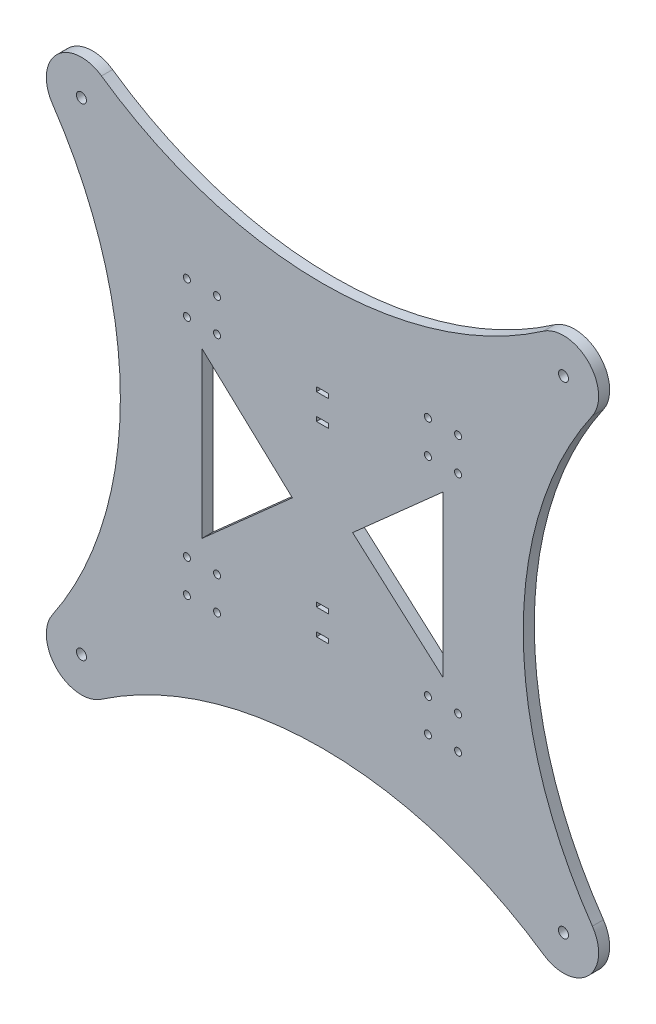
ISO-10303-21;
HEADER;
FILE_DESCRIPTION(('STEP AP214'),'2;1');
FILE_NAME('part.step','',(''),(''),'','','');
FILE_SCHEMA(('AUTOMOTIVE_DESIGN { 1 0 10303 214 1 1 1 1 }'));
ENDSEC;
DATA;
#1=APPLICATION_CONTEXT('core data for automotive mechanical design processes');
#2=APPLICATION_PROTOCOL_DEFINITION('international standard','automotive_design',2000,#1);
#3=PRODUCT_CONTEXT('',#1,'mechanical');
#4=PRODUCT('Part','Part','',(#3));
#5=PRODUCT_RELATED_PRODUCT_CATEGORY('part','',(#4));
#6=PRODUCT_DEFINITION_FORMATION('','',#4);
#7=PRODUCT_DEFINITION_CONTEXT('part definition',#1,'design');
#8=PRODUCT_DEFINITION('design','',#6,#7);
#9=PRODUCT_DEFINITION_SHAPE('','',#8);
#10=(LENGTH_UNIT() NAMED_UNIT(*) SI_UNIT(.MILLI.,.METRE.));
#11=(NAMED_UNIT(*) PLANE_ANGLE_UNIT() SI_UNIT($,.RADIAN.));
#12=(NAMED_UNIT(*) SI_UNIT($,.STERADIAN.) SOLID_ANGLE_UNIT());
#13=UNCERTAINTY_MEASURE_WITH_UNIT(LENGTH_MEASURE(1.E-05),#10,'distance_accuracy_value','');
#14=(GEOMETRIC_REPRESENTATION_CONTEXT(3) GLOBAL_UNCERTAINTY_ASSIGNED_CONTEXT((#13)) GLOBAL_UNIT_ASSIGNED_CONTEXT((#10,
#11,#12)) REPRESENTATION_CONTEXT('',''));
#15=CARTESIAN_POINT('',(0.,0.,0.));
#16=DIRECTION('',(0.,0.,1.));
#17=DIRECTION('',(1.,0.,0.));
#18=AXIS2_PLACEMENT_3D('',#15,#16,#17);
#19=CARTESIAN_POINT('',(86.5242307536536,180.,5.5));
#20=DIRECTION('',(0.,0.,-1.));
#21=DIRECTION('',(-1.,0.,0.));
#22=AXIS2_PLACEMENT_3D('',#19,#20,#21);
#23=PLANE('',#22);
#24=CARTESIAN_POINT('',(0.,0.,5.5));
#25=DIRECTION('',(0.,0.,1.));
#26=DIRECTION('',(1.,0.,0.));
#27=AXIS2_PLACEMENT_3D('',#24,#25,#26);
#28=CIRCLE('',#27,2.5);
#29=CARTESIAN_POINT('',(2.5,0.,5.5));
#30=VERTEX_POINT('',#29);
#31=EDGE_CURVE('E269',#30,#30,#28,.T.);
#32=ORIENTED_EDGE('',*,*,#31,.F.);
#33=EDGE_LOOP('',(#32));
#34=FACE_BOUND('',#33,.T.);
#35=CARTESIAN_POINT('',(-240.,0.,5.5));
#36=DIRECTION('',(0.,0.,1.));
#37=DIRECTION('',(1.,0.,0.));
#38=AXIS2_PLACEMENT_3D('',#35,#36,#37);
#39=CIRCLE('',#38,2.5);
#40=CARTESIAN_POINT('',(-237.5,0.,5.5));
#41=VERTEX_POINT('',#40);
#42=EDGE_CURVE('E275',#41,#41,#39,.T.);
#43=ORIENTED_EDGE('',*,*,#42,.F.);
#44=EDGE_LOOP('',(#43));
#45=FACE_BOUND('',#44,.T.);
#46=CARTESIAN_POINT('',(0.,240.,5.5));
#47=DIRECTION('',(0.,0.,1.));
#48=DIRECTION('',(1.,0.,0.));
#49=AXIS2_PLACEMENT_3D('',#46,#47,#48);
#50=CIRCLE('',#49,2.5);
#51=CARTESIAN_POINT('',(2.5,240.,5.5));
#52=VERTEX_POINT('',#51);
#53=EDGE_CURVE('E281',#52,#52,#50,.T.);
#54=ORIENTED_EDGE('',*,*,#53,.F.);
#55=EDGE_LOOP('',(#54));
#56=FACE_BOUND('',#55,.T.);
#57=CARTESIAN_POINT('',(-240.,240.,5.5));
#58=DIRECTION('',(0.,0.,1.));
#59=DIRECTION('',(1.,0.,0.));
#60=AXIS2_PLACEMENT_3D('',#57,#58,#59);
#61=CIRCLE('',#60,2.5);
#62=CARTESIAN_POINT('',(-237.5,240.,5.5));
#63=VERTEX_POINT('',#62);
#64=EDGE_CURVE('E287',#63,#63,#61,.T.);
#65=ORIENTED_EDGE('',*,*,#64,.F.);
#66=EDGE_LOOP('',(#65));
#67=FACE_BOUND('',#66,.T.);
#68=CARTESIAN_POINT('',(-52.5,51.7500022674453,5.5));
#69=DIRECTION('',(0.,0.,1.));
#70=DIRECTION('',(1.,0.,0.));
#71=AXIS2_PLACEMENT_3D('',#68,#69,#70);
#72=CIRCLE('',#71,1.75);
#73=CARTESIAN_POINT('',(-50.75,51.7500022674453,5.5));
#74=VERTEX_POINT('',#73);
#75=EDGE_CURVE('E293',#74,#74,#72,.T.);
#76=ORIENTED_EDGE('',*,*,#75,.F.);
#77=EDGE_LOOP('',(#76));
#78=FACE_BOUND('',#77,.T.);
#79=CARTESIAN_POINT('',(-67.5,51.7500022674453,5.5));
#80=DIRECTION('',(0.,0.,1.));
#81=DIRECTION('',(1.,0.,0.));
#82=AXIS2_PLACEMENT_3D('',#79,#80,#81);
#83=CIRCLE('',#82,1.75);
#84=CARTESIAN_POINT('',(-65.75,51.7500022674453,5.5));
#85=VERTEX_POINT('',#84);
#86=EDGE_CURVE('E299',#85,#85,#83,.T.);
#87=ORIENTED_EDGE('',*,*,#86,.F.);
#88=EDGE_LOOP('',(#87));
#89=FACE_BOUND('',#88,.T.);
#90=CARTESIAN_POINT('',(-52.5,68.2500022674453,5.5));
#91=DIRECTION('',(0.,0.,1.));
#92=DIRECTION('',(1.,0.,0.));
#93=AXIS2_PLACEMENT_3D('',#90,#91,#92);
#94=CIRCLE('',#93,1.75);
#95=CARTESIAN_POINT('',(-50.75,68.2500022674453,5.5));
#96=VERTEX_POINT('',#95);
#97=EDGE_CURVE('E305',#96,#96,#94,.T.);
#98=ORIENTED_EDGE('',*,*,#97,.F.);
#99=EDGE_LOOP('',(#98));
#100=FACE_BOUND('',#99,.T.);
#101=CARTESIAN_POINT('',(-67.5,68.2500022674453,5.5));
#102=DIRECTION('',(0.,0.,1.));
#103=DIRECTION('',(1.,0.,0.));
#104=AXIS2_PLACEMENT_3D('',#101,#102,#103);
#105=CIRCLE('',#104,1.75);
#106=CARTESIAN_POINT('',(-65.75,68.2500022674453,5.5));
#107=VERTEX_POINT('',#106);
#108=EDGE_CURVE('E311',#107,#107,#105,.T.);
#109=ORIENTED_EDGE('',*,*,#108,.F.);
#110=EDGE_LOOP('',(#109));
#111=FACE_BOUND('',#110,.T.);
#112=CARTESIAN_POINT('',(-172.499997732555,51.7500022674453,5.5));
#113=DIRECTION('',(0.,0.,1.));
#114=DIRECTION('',(1.,0.,0.));
#115=AXIS2_PLACEMENT_3D('',#112,#113,#114);
#116=CIRCLE('',#115,1.75000000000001);
#117=CARTESIAN_POINT('',(-170.749997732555,51.7500022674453,5.5));
#118=VERTEX_POINT('',#117);
#119=EDGE_CURVE('E317',#118,#118,#116,.T.);
#120=ORIENTED_EDGE('',*,*,#119,.F.);
#121=EDGE_LOOP('',(#120));
#122=FACE_BOUND('',#121,.T.);
#123=CARTESIAN_POINT('',(-187.499997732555,51.7500022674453,5.5));
#124=DIRECTION('',(0.,0.,1.));
#125=DIRECTION('',(1.,0.,0.));
#126=AXIS2_PLACEMENT_3D('',#123,#124,#125);
#127=CIRCLE('',#126,1.75000000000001);
#128=CARTESIAN_POINT('',(-185.749997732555,51.7500022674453,5.5));
#129=VERTEX_POINT('',#128);
#130=EDGE_CURVE('E323',#129,#129,#127,.T.);
#131=ORIENTED_EDGE('',*,*,#130,.F.);
#132=EDGE_LOOP('',(#131));
#133=FACE_BOUND('',#132,.T.);
#134=CARTESIAN_POINT('',(-172.499997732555,68.2500022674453,5.5));
#135=DIRECTION('',(0.,0.,1.));
#136=DIRECTION('',(1.,0.,0.));
#137=AXIS2_PLACEMENT_3D('',#134,#135,#136);
#138=CIRCLE('',#137,1.75000000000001);
#139=CARTESIAN_POINT('',(-170.749997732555,68.2500022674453,5.5));
#140=VERTEX_POINT('',#139);
#141=EDGE_CURVE('E329',#140,#140,#138,.T.);
#142=ORIENTED_EDGE('',*,*,#141,.F.);
#143=EDGE_LOOP('',(#142));
#144=FACE_BOUND('',#143,.T.);
#145=CARTESIAN_POINT('',(-187.499997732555,68.2500022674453,5.5));
#146=DIRECTION('',(0.,0.,1.));
#147=DIRECTION('',(1.,0.,0.));
#148=AXIS2_PLACEMENT_3D('',#145,#146,#147);
#149=CIRCLE('',#148,1.74999999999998);
#150=CARTESIAN_POINT('',(-185.749997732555,68.2500022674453,5.5));
#151=VERTEX_POINT('',#150);
#152=EDGE_CURVE('E335',#151,#151,#149,.T.);
#153=ORIENTED_EDGE('',*,*,#152,.F.);
#154=EDGE_LOOP('',(#153));
#155=FACE_BOUND('',#154,.T.);
#156=CARTESIAN_POINT('',(-52.5000000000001,171.749997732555,5.5));
#157=DIRECTION('',(0.,0.,1.));
#158=DIRECTION('',(1.,0.,0.));
#159=AXIS2_PLACEMENT_3D('',#156,#157,#158);
#160=CIRCLE('',#159,1.74999999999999);
#161=CARTESIAN_POINT('',(-50.7500000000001,171.749997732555,5.5));
#162=VERTEX_POINT('',#161);
#163=EDGE_CURVE('E341',#162,#162,#160,.T.);
#164=ORIENTED_EDGE('',*,*,#163,.F.);
#165=EDGE_LOOP('',(#164));
#166=FACE_BOUND('',#165,.T.);
#167=CARTESIAN_POINT('',(-67.500002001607,171.749997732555,5.5));
#168=DIRECTION('',(0.,0.,1.));
#169=DIRECTION('',(1.,0.,0.));
#170=AXIS2_PLACEMENT_3D('',#167,#168,#169);
#171=CIRCLE('',#170,1.75);
#172=CARTESIAN_POINT('',(-65.750002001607,171.749997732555,5.5));
#173=VERTEX_POINT('',#172);
#174=EDGE_CURVE('E347',#173,#173,#171,.T.);
#175=ORIENTED_EDGE('',*,*,#174,.F.);
#176=EDGE_LOOP('',(#175));
#177=FACE_BOUND('',#176,.T.);
#178=CARTESIAN_POINT('',(-52.5000000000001,188.249997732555,5.5));
#179=DIRECTION('',(0.,0.,1.));
#180=DIRECTION('',(1.,0.,0.));
#181=AXIS2_PLACEMENT_3D('',#178,#179,#180);
#182=CIRCLE('',#181,1.74999999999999);
#183=CARTESIAN_POINT('',(-50.7500000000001,188.249997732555,5.5));
#184=VERTEX_POINT('',#183);
#185=EDGE_CURVE('E353',#184,#184,#182,.T.);
#186=ORIENTED_EDGE('',*,*,#185,.F.);
#187=EDGE_LOOP('',(#186));
#188=FACE_BOUND('',#187,.T.);
#189=CARTESIAN_POINT('',(-67.500002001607,188.249997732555,5.5));
#190=DIRECTION('',(0.,0.,1.));
#191=DIRECTION('',(1.,0.,0.));
#192=AXIS2_PLACEMENT_3D('',#189,#190,#191);
#193=CIRCLE('',#192,1.75);
#194=CARTESIAN_POINT('',(-65.750002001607,188.249997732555,5.5));
#195=VERTEX_POINT('',#194);
#196=EDGE_CURVE('E359',#195,#195,#193,.T.);
#197=ORIENTED_EDGE('',*,*,#196,.F.);
#198=EDGE_LOOP('',(#197));
#199=FACE_BOUND('',#198,.T.);
#200=CARTESIAN_POINT('',(-172.499997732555,171.749997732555,5.5));
#201=DIRECTION('',(0.,0.,1.));
#202=DIRECTION('',(1.,0.,0.));
#203=AXIS2_PLACEMENT_3D('',#200,#201,#202);
#204=CIRCLE('',#203,1.74999999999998);
#205=CARTESIAN_POINT('',(-170.749997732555,171.749997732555,5.5));
#206=VERTEX_POINT('',#205);
#207=EDGE_CURVE('E365',#206,#206,#204,.T.);
#208=ORIENTED_EDGE('',*,*,#207,.F.);
#209=EDGE_LOOP('',(#208));
#210=FACE_BOUND('',#209,.T.);
#211=CARTESIAN_POINT('',(-187.499997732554,171.749997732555,5.5));
#212=DIRECTION('',(0.,0.,1.));
#213=DIRECTION('',(1.,0.,0.));
#214=AXIS2_PLACEMENT_3D('',#211,#212,#213);
#215=CIRCLE('',#214,1.74999999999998);
#216=CARTESIAN_POINT('',(-185.749997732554,171.749997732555,5.5));
#217=VERTEX_POINT('',#216);
#218=EDGE_CURVE('E371',#217,#217,#215,.T.);
#219=ORIENTED_EDGE('',*,*,#218,.F.);
#220=EDGE_LOOP('',(#219));
#221=FACE_BOUND('',#220,.T.);
#222=CARTESIAN_POINT('',(-172.499997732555,188.249997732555,5.5));
#223=DIRECTION('',(0.,0.,1.));
#224=DIRECTION('',(1.,0.,0.));
#225=AXIS2_PLACEMENT_3D('',#222,#223,#224);
#226=CIRCLE('',#225,1.74999999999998);
#227=CARTESIAN_POINT('',(-170.749997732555,188.249997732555,5.5));
#228=VERTEX_POINT('',#227);
#229=EDGE_CURVE('E377',#228,#228,#226,.T.);
#230=ORIENTED_EDGE('',*,*,#229,.F.);
#231=EDGE_LOOP('',(#230));
#232=FACE_BOUND('',#231,.T.);
#233=CARTESIAN_POINT('',(-187.499997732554,188.249997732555,5.5));
#234=DIRECTION('',(0.,0.,1.));
#235=DIRECTION('',(1.,0.,0.));
#236=AXIS2_PLACEMENT_3D('',#233,#234,#235);
#237=CIRCLE('',#236,1.75000000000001);
#238=CARTESIAN_POINT('',(-185.749997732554,188.249997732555,5.5));
#239=VERTEX_POINT('',#238);
#240=EDGE_CURVE('E383',#239,#239,#237,.T.);
#241=ORIENTED_EDGE('',*,*,#240,.F.);
#242=EDGE_LOOP('',(#241));
#243=FACE_BOUND('',#242,.T.);
#244=DIRECTION('',(0.,1.,0.));
#245=VECTOR('',#244,1.);
#246=CARTESIAN_POINT('',(-117.,66.0500022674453,5.5));
#247=LINE('',#246,#245);
#248=CARTESIAN_POINT('',(-117.,66.0500022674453,5.5));
#249=VERTEX_POINT('',#248);
#250=CARTESIAN_POINT('',(-117.,68.2500022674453,5.5));
#251=VERTEX_POINT('',#250);
#252=EDGE_CURVE('E389',#249,#251,#247,.T.);
#253=ORIENTED_EDGE('',*,*,#252,.F.);
#254=DIRECTION('',(1.,0.,0.));
#255=VECTOR('',#254,1.);
#256=CARTESIAN_POINT('',(-123.,66.0500022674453,5.5));
#257=LINE('',#256,#255);
#258=CARTESIAN_POINT('',(-123.,66.0500022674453,5.5));
#259=VERTEX_POINT('',#258);
#260=EDGE_CURVE('E397',#259,#249,#257,.T.);
#261=ORIENTED_EDGE('',*,*,#260,.F.);
#262=DIRECTION('',(0.,-1.,0.));
#263=VECTOR('',#262,1.);
#264=CARTESIAN_POINT('',(-123.,68.2500022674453,5.5));
#265=LINE('',#264,#263);
#266=CARTESIAN_POINT('',(-123.,68.2500022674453,5.5));
#267=VERTEX_POINT('',#266);
#268=EDGE_CURVE('E394',#267,#259,#265,.T.);
#269=ORIENTED_EDGE('',*,*,#268,.F.);
#270=DIRECTION('',(-1.,0.,0.));
#271=VECTOR('',#270,1.);
#272=CARTESIAN_POINT('',(-117.,68.2500022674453,5.5));
#273=LINE('',#272,#271);
#274=EDGE_CURVE('E391',#251,#267,#273,.T.);
#275=ORIENTED_EDGE('',*,*,#274,.F.);
#276=EDGE_LOOP('',(#253,#261,#269,#275));
#277=FACE_BOUND('',#276,.T.);
#278=DIRECTION('',(-0.747409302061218,-0.664363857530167,0.));
#279=VECTOR('',#278,1.);
#280=CARTESIAN_POINT('',(-60.0000010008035,160.000001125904,5.5));
#281=LINE('',#280,#279);
#282=CARTESIAN_POINT('',(-60.0000010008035,160.000001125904,5.5));
#283=VERTEX_POINT('',#282);
#284=CARTESIAN_POINT('',(-105.,120.,5.5));
#285=VERTEX_POINT('',#284);
#286=EDGE_CURVE('E451',#283,#285,#281,.T.);
#287=ORIENTED_EDGE('',*,*,#286,.F.);
#288=DIRECTION('',(0.,1.,0.));
#289=VECTOR('',#288,1.);
#290=CARTESIAN_POINT('',(-60.0000010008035,80.0000011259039,5.5));
#291=LINE('',#290,#289);
#292=CARTESIAN_POINT('',(-60.0000010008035,80.0000011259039,5.5));
#293=VERTEX_POINT('',#292);
#294=EDGE_CURVE('E457',#293,#283,#291,.T.);
#295=ORIENTED_EDGE('',*,*,#294,.F.);
#296=DIRECTION('',(0.747409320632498,-0.664363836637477,0.));
#297=VECTOR('',#296,1.);
#298=CARTESIAN_POINT('',(-105.,120.,5.5));
#299=LINE('',#298,#297);
#300=EDGE_CURVE('E453',#285,#293,#299,.T.);
#301=ORIENTED_EDGE('',*,*,#300,.F.);
#302=EDGE_LOOP('',(#287,#295,#301));
#303=FACE_BOUND('',#302,.T.);
#304=DIRECTION('',(0.,1.,0.));
#305=VECTOR('',#304,1.);
#306=CARTESIAN_POINT('',(-117.,78.9,5.5));
#307=LINE('',#306,#305);
#308=CARTESIAN_POINT('',(-117.,78.9,5.5));
#309=VERTEX_POINT('',#308);
#310=CARTESIAN_POINT('',(-117.,81.1,5.5));
#311=VERTEX_POINT('',#310);
#312=EDGE_CURVE('E499',#309,#311,#307,.T.);
#313=ORIENTED_EDGE('',*,*,#312,.F.);
#314=DIRECTION('',(1.,0.,0.));
#315=VECTOR('',#314,1.);
#316=CARTESIAN_POINT('',(-123.,78.9,5.5));
#317=LINE('',#316,#315);
#318=CARTESIAN_POINT('',(-123.,78.9,5.5));
#319=VERTEX_POINT('',#318);
#320=EDGE_CURVE('E507',#319,#309,#317,.T.);
#321=ORIENTED_EDGE('',*,*,#320,.F.);
#322=DIRECTION('',(0.,-1.,0.));
#323=VECTOR('',#322,1.);
#324=CARTESIAN_POINT('',(-123.,81.1,5.5));
#325=LINE('',#324,#323);
#326=CARTESIAN_POINT('',(-123.,81.1,5.5));
#327=VERTEX_POINT('',#326);
#328=EDGE_CURVE('E504',#327,#319,#325,.T.);
#329=ORIENTED_EDGE('',*,*,#328,.F.);
#330=DIRECTION('',(-1.,0.,0.));
#331=VECTOR('',#330,1.);
#332=CARTESIAN_POINT('',(-117.,81.1,5.5));
#333=LINE('',#332,#331);
#334=EDGE_CURVE('E501',#311,#327,#333,.T.);
#335=ORIENTED_EDGE('',*,*,#334,.F.);
#336=EDGE_LOOP('',(#313,#321,#329,#335));
#337=FACE_BOUND('',#336,.T.);
#338=CARTESIAN_POINT('',(173.048461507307,120.,5.5));
#339=DIRECTION('',(0.,0.,-1.));
#340=DIRECTION('',(-1.,0.,0.));
#341=AXIS2_PLACEMENT_3D('',#338,#339,#340);
#342=CIRCLE('',#341,193.084353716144);
#343=CARTESIAN_POINT('',(14.3806888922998,9.97225084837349,5.5));
#344=VERTEX_POINT('',#343);
#345=CARTESIAN_POINT('',(14.3806888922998,230.027749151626,5.5));
#346=VERTEX_POINT('',#345);
#347=EDGE_CURVE('E530',#344,#346,#342,.T.);
#348=ORIENTED_EDGE('',*,*,#347,.T.);
#349=CARTESIAN_POINT('',(0.,240.,5.5));
#350=DIRECTION('',(0.,0.,1.));
#351=DIRECTION('',(1.,0.,0.));
#352=AXIS2_PLACEMENT_3D('',#349,#350,#351);
#353=CIRCLE('',#352,17.5);
#354=CARTESIAN_POINT('',(-9.97572764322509,254.378277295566,5.5));
#355=VERTEX_POINT('',#354);
#356=EDGE_CURVE('E533',#346,#355,#353,.T.);
#357=ORIENTED_EDGE('',*,*,#356,.T.);
#358=CARTESIAN_POINT('',(-120.,412.959140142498,5.5));
#359=DIRECTION('',(0.,0.,-1.));
#360=DIRECTION('',(1.,0.,0.));
#361=AXIS2_PLACEMENT_3D('',#358,#359,#360);
#362=CIRCLE('',#361,193.010959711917);
#363=CARTESIAN_POINT('',(-230.024272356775,254.378277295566,5.5));
#364=VERTEX_POINT('',#363);
#365=EDGE_CURVE('E536',#355,#364,#362,.T.);
#366=ORIENTED_EDGE('',*,*,#365,.T.);
#367=CARTESIAN_POINT('',(-240.,240.,5.5));
#368=DIRECTION('',(0.,0.,1.));
#369=DIRECTION('',(1.,0.,0.));
#370=AXIS2_PLACEMENT_3D('',#367,#368,#369);
#371=CIRCLE('',#370,17.5);
#372=CARTESIAN_POINT('',(-254.481950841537,230.17538296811,5.5));
#373=VERTEX_POINT('',#372);
#374=EDGE_CURVE('E538',#364,#373,#371,.T.);
#375=ORIENTED_EDGE('',*,*,#374,.T.);
#376=CARTESIAN_POINT('',(-416.885683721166,120.,5.5));
#377=DIRECTION('',(0.,0.,-1.));
#378=DIRECTION('',(1.,0.,0.));
#379=AXIS2_PLACEMENT_3D('',#376,#377,#378);
#380=CIRCLE('',#379,196.248789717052);
#381=CARTESIAN_POINT('',(-254.481950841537,9.82461703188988,5.5));
#382=VERTEX_POINT('',#381);
#383=EDGE_CURVE('E540',#373,#382,#380,.T.);
#384=ORIENTED_EDGE('',*,*,#383,.T.);
#385=CARTESIAN_POINT('',(-240.,0.,5.5));
#386=DIRECTION('',(0.,0.,1.));
#387=DIRECTION('',(1.,0.,0.));
#388=AXIS2_PLACEMENT_3D('',#385,#386,#387);
#389=CIRCLE('',#388,17.5);
#390=CARTESIAN_POINT('',(-230.146404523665,-14.4622493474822,5.5));
#391=VERTEX_POINT('',#390);
#392=EDGE_CURVE('E542',#382,#391,#389,.T.);
#393=ORIENTED_EDGE('',*,*,#392,.T.);
#394=CARTESIAN_POINT('',(-120.,-176.125549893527,5.5));
#395=DIRECTION('',(0.,0.,-1.));
#396=DIRECTION('',(-1.,0.,0.));
#397=AXIS2_PLACEMENT_3D('',#394,#395,#396);
#398=CIRCLE('',#397,195.620175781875);
#399=CARTESIAN_POINT('',(-9.85359547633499,-14.4622493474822,5.5));
#400=VERTEX_POINT('',#399);
#401=EDGE_CURVE('E544',#391,#400,#398,.T.);
#402=ORIENTED_EDGE('',*,*,#401,.T.);
#403=CARTESIAN_POINT('',(0.,0.,5.5));
#404=DIRECTION('',(0.,0.,1.));
#405=DIRECTION('',(1.,0.,0.));
#406=AXIS2_PLACEMENT_3D('',#403,#404,#405);
#407=CIRCLE('',#406,17.5);
#408=EDGE_CURVE('E546',#400,#344,#407,.T.);
#409=ORIENTED_EDGE('',*,*,#408,.T.);
#410=EDGE_LOOP('',(#348,#357,#366,#375,#384,#393,#402,#409));
#411=FACE_BOUND('',#410,.T.);
#412=DIRECTION('',(0.,-1.,0.));
#413=VECTOR('',#412,1.);
#414=CARTESIAN_POINT('',(-179.999997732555,80.,5.5));
#415=LINE('',#414,#413);
#416=CARTESIAN_POINT('',(-179.999997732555,161.845451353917,5.5));
#417=VERTEX_POINT('',#416);
#418=CARTESIAN_POINT('',(-179.999997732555,80.,5.5));
#419=VERTEX_POINT('',#418);
#420=EDGE_CURVE('E475',#417,#419,#415,.T.);
#421=ORIENTED_EDGE('',*,*,#420,.F.);
#422=DIRECTION('',(-0.732308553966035,0.68097296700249,0.));
#423=VECTOR('',#422,1.);
#424=CARTESIAN_POINT('',(-179.999997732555,161.845451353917,5.5));
#425=LINE('',#424,#423);
#426=CARTESIAN_POINT('',(-135.,120.,5.5));
#427=VERTEX_POINT('',#426);
#428=EDGE_CURVE('E481',#427,#417,#425,.T.);
#429=ORIENTED_EDGE('',*,*,#428,.F.);
#430=DIRECTION('',(0.747409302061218,0.664363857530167,0.));
#431=VECTOR('',#430,1.);
#432=CARTESIAN_POINT('',(-179.999997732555,80.,5.5));
#433=LINE('',#432,#431);
#434=EDGE_CURVE('E477',#419,#427,#433,.T.);
#435=ORIENTED_EDGE('',*,*,#434,.F.);
#436=EDGE_LOOP('',(#421,#429,#435));
#437=FACE_BOUND('',#436,.T.);
#438=DIRECTION('',(0.,1.,0.));
#439=VECTOR('',#438,1.);
#440=CARTESIAN_POINT('',(-117.,171.749997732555,5.5));
#441=LINE('',#440,#439);
#442=CARTESIAN_POINT('',(-117.,171.749997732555,5.5));
#443=VERTEX_POINT('',#442);
#444=CARTESIAN_POINT('',(-117.,173.949997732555,5.5));
#445=VERTEX_POINT('',#444);
#446=EDGE_CURVE('E420',#443,#445,#441,.T.);
#447=ORIENTED_EDGE('',*,*,#446,.F.);
#448=DIRECTION('',(1.,0.,0.));
#449=VECTOR('',#448,1.);
#450=CARTESIAN_POINT('',(-123.,171.749997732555,5.5));
#451=LINE('',#450,#449);
#452=CARTESIAN_POINT('',(-123.,171.749997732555,5.5));
#453=VERTEX_POINT('',#452);
#454=EDGE_CURVE('E428',#453,#443,#451,.T.);
#455=ORIENTED_EDGE('',*,*,#454,.F.);
#456=DIRECTION('',(0.,-1.,0.));
#457=VECTOR('',#456,1.);
#458=CARTESIAN_POINT('',(-123.,173.949997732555,5.5));
#459=LINE('',#458,#457);
#460=CARTESIAN_POINT('',(-123.,173.949997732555,5.5));
#461=VERTEX_POINT('',#460);
#462=EDGE_CURVE('E425',#461,#453,#459,.T.);
#463=ORIENTED_EDGE('',*,*,#462,.F.);
#464=DIRECTION('',(-1.,0.,0.));
#465=VECTOR('',#464,1.);
#466=CARTESIAN_POINT('',(-117.,173.949997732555,5.5));
#467=LINE('',#466,#465);
#468=EDGE_CURVE('E422',#445,#461,#467,.T.);
#469=ORIENTED_EDGE('',*,*,#468,.F.);
#470=EDGE_LOOP('',(#447,#455,#463,#469));
#471=FACE_BOUND('',#470,.T.);
#472=DIRECTION('',(0.,-1.,0.));
#473=VECTOR('',#472,1.);
#474=CARTESIAN_POINT('',(-123.,161.1,5.5));
#475=LINE('',#474,#473);
#476=CARTESIAN_POINT('',(-123.,161.1,5.5));
#477=VERTEX_POINT('',#476);
#478=CARTESIAN_POINT('',(-123.,158.9,5.5));
#479=VERTEX_POINT('',#478);
#480=EDGE_CURVE('E231',#477,#479,#475,.T.);
#481=ORIENTED_EDGE('',*,*,#480,.F.);
#482=DIRECTION('',(-1.,0.,0.));
#483=VECTOR('',#482,1.);
#484=CARTESIAN_POINT('',(-117.,161.1,5.5));
#485=LINE('',#484,#483);
#486=CARTESIAN_POINT('',(-117.,161.1,5.5));
#487=VERTEX_POINT('',#486);
#488=EDGE_CURVE('E254',#487,#477,#485,.T.);
#489=ORIENTED_EDGE('',*,*,#488,.F.);
#490=DIRECTION('',(0.,1.,0.));
#491=VECTOR('',#490,1.);
#492=CARTESIAN_POINT('',(-117.,158.9,5.5));
#493=LINE('',#492,#491);
#494=CARTESIAN_POINT('',(-117.,158.9,5.5));
#495=VERTEX_POINT('',#494);
#496=EDGE_CURVE('E252',#495,#487,#493,.T.);
#497=ORIENTED_EDGE('',*,*,#496,.F.);
#498=DIRECTION('',(1.,0.,0.));
#499=VECTOR('',#498,1.);
#500=CARTESIAN_POINT('',(-123.,158.9,5.5));
#501=LINE('',#500,#499);
#502=EDGE_CURVE('E239',#479,#495,#501,.T.);
#503=ORIENTED_EDGE('',*,*,#502,.F.);
#504=EDGE_LOOP('',(#481,#489,#497,#503));
#505=FACE_BOUND('',#504,.T.);
#506=ADVANCED_FACE('F36',(#34,#45,#56,#67,#78,#89,#100,#111,#122,#133,#144,#155,#166,#177,#188,
#199,#210,#221,#232,#243,#277,#303,#337,#411,#437,#471,#505),#23,.F.);
#507=CARTESIAN_POINT('',(86.5242307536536,180.,0.));
#508=DIRECTION('',(0.,0.,-1.));
#509=DIRECTION('',(-1.,0.,0.));
#510=AXIS2_PLACEMENT_3D('',#507,#508,#509);
#511=PLANE('',#510);
#512=CARTESIAN_POINT('',(-240.,0.,0.));
#513=DIRECTION('',(0.,0.,1.));
#514=DIRECTION('',(1.,0.,0.));
#515=AXIS2_PLACEMENT_3D('',#512,#513,#514);
#516=CIRCLE('',#515,2.5);
#517=CARTESIAN_POINT('',(-237.5,0.,0.));
#518=VERTEX_POINT('',#517);
#519=EDGE_CURVE('E272',#518,#518,#516,.T.);
#520=ORIENTED_EDGE('',*,*,#519,.T.);
#521=EDGE_LOOP('',(#520));
#522=FACE_BOUND('',#521,.T.);
#523=CARTESIAN_POINT('',(-240.,240.,0.));
#524=DIRECTION('',(0.,0.,1.));
#525=DIRECTION('',(1.,0.,0.));
#526=AXIS2_PLACEMENT_3D('',#523,#524,#525);
#527=CIRCLE('',#526,2.5);
#528=CARTESIAN_POINT('',(-237.5,240.,0.));
#529=VERTEX_POINT('',#528);
#530=EDGE_CURVE('E284',#529,#529,#527,.T.);
#531=ORIENTED_EDGE('',*,*,#530,.T.);
#532=EDGE_LOOP('',(#531));
#533=FACE_BOUND('',#532,.T.);
#534=CARTESIAN_POINT('',(-67.5,51.7500022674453,0.));
#535=DIRECTION('',(0.,0.,1.));
#536=DIRECTION('',(1.,0.,0.));
#537=AXIS2_PLACEMENT_3D('',#534,#535,#536);
#538=CIRCLE('',#537,1.75);
#539=CARTESIAN_POINT('',(-65.75,51.7500022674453,0.));
#540=VERTEX_POINT('',#539);
#541=EDGE_CURVE('E296',#540,#540,#538,.T.);
#542=ORIENTED_EDGE('',*,*,#541,.T.);
#543=EDGE_LOOP('',(#542));
#544=FACE_BOUND('',#543,.T.);
#545=CARTESIAN_POINT('',(-67.5,68.2500022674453,0.));
#546=DIRECTION('',(0.,0.,1.));
#547=DIRECTION('',(1.,0.,0.));
#548=AXIS2_PLACEMENT_3D('',#545,#546,#547);
#549=CIRCLE('',#548,1.75);
#550=CARTESIAN_POINT('',(-65.75,68.2500022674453,0.));
#551=VERTEX_POINT('',#550);
#552=EDGE_CURVE('E308',#551,#551,#549,.T.);
#553=ORIENTED_EDGE('',*,*,#552,.T.);
#554=EDGE_LOOP('',(#553));
#555=FACE_BOUND('',#554,.T.);
#556=CARTESIAN_POINT('',(-187.499997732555,51.7500022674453,0.));
#557=DIRECTION('',(0.,0.,1.));
#558=DIRECTION('',(1.,0.,0.));
#559=AXIS2_PLACEMENT_3D('',#556,#557,#558);
#560=CIRCLE('',#559,1.75000000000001);
#561=CARTESIAN_POINT('',(-185.749997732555,51.7500022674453,0.));
#562=VERTEX_POINT('',#561);
#563=EDGE_CURVE('E320',#562,#562,#560,.T.);
#564=ORIENTED_EDGE('',*,*,#563,.T.);
#565=EDGE_LOOP('',(#564));
#566=FACE_BOUND('',#565,.T.);
#567=CARTESIAN_POINT('',(-187.499997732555,68.2500022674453,0.));
#568=DIRECTION('',(0.,0.,1.));
#569=DIRECTION('',(1.,0.,0.));
#570=AXIS2_PLACEMENT_3D('',#567,#568,#569);
#571=CIRCLE('',#570,1.74999999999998);
#572=CARTESIAN_POINT('',(-185.749997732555,68.2500022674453,0.));
#573=VERTEX_POINT('',#572);
#574=EDGE_CURVE('E332',#573,#573,#571,.T.);
#575=ORIENTED_EDGE('',*,*,#574,.T.);
#576=EDGE_LOOP('',(#575));
#577=FACE_BOUND('',#576,.T.);
#578=CARTESIAN_POINT('',(-67.500002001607,171.749997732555,0.));
#579=DIRECTION('',(0.,0.,1.));
#580=DIRECTION('',(1.,0.,0.));
#581=AXIS2_PLACEMENT_3D('',#578,#579,#580);
#582=CIRCLE('',#581,1.75);
#583=CARTESIAN_POINT('',(-65.750002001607,171.749997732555,0.));
#584=VERTEX_POINT('',#583);
#585=EDGE_CURVE('E344',#584,#584,#582,.T.);
#586=ORIENTED_EDGE('',*,*,#585,.T.);
#587=EDGE_LOOP('',(#586));
#588=FACE_BOUND('',#587,.T.);
#589=CARTESIAN_POINT('',(-67.500002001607,188.249997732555,0.));
#590=DIRECTION('',(0.,0.,1.));
#591=DIRECTION('',(1.,0.,0.));
#592=AXIS2_PLACEMENT_3D('',#589,#590,#591);
#593=CIRCLE('',#592,1.75);
#594=CARTESIAN_POINT('',(-65.750002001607,188.249997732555,0.));
#595=VERTEX_POINT('',#594);
#596=EDGE_CURVE('E356',#595,#595,#593,.T.);
#597=ORIENTED_EDGE('',*,*,#596,.T.);
#598=EDGE_LOOP('',(#597));
#599=FACE_BOUND('',#598,.T.);
#600=CARTESIAN_POINT('',(-187.499997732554,171.749997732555,0.));
#601=DIRECTION('',(0.,0.,1.));
#602=DIRECTION('',(1.,0.,0.));
#603=AXIS2_PLACEMENT_3D('',#600,#601,#602);
#604=CIRCLE('',#603,1.74999999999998);
#605=CARTESIAN_POINT('',(-185.749997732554,171.749997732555,0.));
#606=VERTEX_POINT('',#605);
#607=EDGE_CURVE('E368',#606,#606,#604,.T.);
#608=ORIENTED_EDGE('',*,*,#607,.T.);
#609=EDGE_LOOP('',(#608));
#610=FACE_BOUND('',#609,.T.);
#611=CARTESIAN_POINT('',(-187.499997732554,188.249997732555,0.));
#612=DIRECTION('',(0.,0.,1.));
#613=DIRECTION('',(1.,0.,0.));
#614=AXIS2_PLACEMENT_3D('',#611,#612,#613);
#615=CIRCLE('',#614,1.75000000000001);
#616=CARTESIAN_POINT('',(-185.749997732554,188.249997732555,0.));
#617=VERTEX_POINT('',#616);
#618=EDGE_CURVE('E380',#617,#617,#615,.T.);
#619=ORIENTED_EDGE('',*,*,#618,.T.);
#620=EDGE_LOOP('',(#619));
#621=FACE_BOUND('',#620,.T.);
#622=CARTESIAN_POINT('',(173.048461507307,120.,0.));
#623=DIRECTION('',(0.,0.,-1.));
#624=DIRECTION('',(-1.,0.,0.));
#625=AXIS2_PLACEMENT_3D('',#622,#623,#624);
#626=CIRCLE('',#625,193.084353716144);
#627=CARTESIAN_POINT('',(14.3806888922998,9.97225084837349,0.));
#628=VERTEX_POINT('',#627);
#629=CARTESIAN_POINT('',(14.3806888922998,230.027749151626,0.));
#630=VERTEX_POINT('',#629);
#631=EDGE_CURVE('E529',#628,#630,#626,.T.);
#632=ORIENTED_EDGE('',*,*,#631,.F.);
#633=CARTESIAN_POINT('',(0.,0.,0.));
#634=DIRECTION('',(0.,0.,1.));
#635=DIRECTION('',(1.,0.,0.));
#636=AXIS2_PLACEMENT_3D('',#633,#634,#635);
#637=CIRCLE('',#636,17.5);
#638=CARTESIAN_POINT('',(-9.85359547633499,-14.4622493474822,0.));
#639=VERTEX_POINT('',#638);
#640=EDGE_CURVE('E534',#639,#628,#637,.T.);
#641=ORIENTED_EDGE('',*,*,#640,.F.);
#642=CARTESIAN_POINT('',(-120.,-176.125549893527,0.));
#643=DIRECTION('',(0.,0.,-1.));
#644=DIRECTION('',(-1.,0.,0.));
#645=AXIS2_PLACEMENT_3D('',#642,#643,#644);
#646=CIRCLE('',#645,195.620175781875);
#647=CARTESIAN_POINT('',(-230.146404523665,-14.4622493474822,0.));
#648=VERTEX_POINT('',#647);
#649=EDGE_CURVE('E561',#648,#639,#646,.T.);
#650=ORIENTED_EDGE('',*,*,#649,.F.);
#651=CARTESIAN_POINT('',(-240.,0.,0.));
#652=DIRECTION('',(0.,0.,1.));
#653=DIRECTION('',(1.,0.,0.));
#654=AXIS2_PLACEMENT_3D('',#651,#652,#653);
#655=CIRCLE('',#654,17.5);
#656=CARTESIAN_POINT('',(-254.481950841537,9.82461703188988,0.));
#657=VERTEX_POINT('',#656);
#658=EDGE_CURVE('E559',#657,#648,#655,.T.);
#659=ORIENTED_EDGE('',*,*,#658,.F.);
#660=CARTESIAN_POINT('',(-416.885683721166,120.,0.));
#661=DIRECTION('',(0.,0.,-1.));
#662=DIRECTION('',(1.,0.,0.));
#663=AXIS2_PLACEMENT_3D('',#660,#661,#662);
#664=CIRCLE('',#663,196.248789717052);
#665=CARTESIAN_POINT('',(-254.481950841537,230.17538296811,0.));
#666=VERTEX_POINT('',#665);
#667=EDGE_CURVE('E557',#666,#657,#664,.T.);
#668=ORIENTED_EDGE('',*,*,#667,.F.);
#669=CARTESIAN_POINT('',(-240.,240.,0.));
#670=DIRECTION('',(0.,0.,1.));
#671=DIRECTION('',(1.,0.,0.));
#672=AXIS2_PLACEMENT_3D('',#669,#670,#671);
#673=CIRCLE('',#672,17.5);
#674=CARTESIAN_POINT('',(-230.024272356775,254.378277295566,0.));
#675=VERTEX_POINT('',#674);
#676=EDGE_CURVE('E555',#675,#666,#673,.T.);
#677=ORIENTED_EDGE('',*,*,#676,.F.);
#678=CARTESIAN_POINT('',(-120.,412.959140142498,0.));
#679=DIRECTION('',(0.,0.,-1.));
#680=DIRECTION('',(1.,0.,0.));
#681=AXIS2_PLACEMENT_3D('',#678,#679,#680);
#682=CIRCLE('',#681,193.010959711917);
#683=CARTESIAN_POINT('',(-9.97572764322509,254.378277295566,0.));
#684=VERTEX_POINT('',#683);
#685=EDGE_CURVE('E553',#684,#675,#682,.T.);
#686=ORIENTED_EDGE('',*,*,#685,.F.);
#687=CARTESIAN_POINT('',(0.,240.,0.));
#688=DIRECTION('',(0.,0.,1.));
#689=DIRECTION('',(1.,0.,0.));
#690=AXIS2_PLACEMENT_3D('',#687,#688,#689);
#691=CIRCLE('',#690,17.5);
#692=EDGE_CURVE('E551',#630,#684,#691,.T.);
#693=ORIENTED_EDGE('',*,*,#692,.F.);
#694=EDGE_LOOP('',(#632,#641,#650,#659,#668,#677,#686,#693));
#695=FACE_BOUND('',#694,.T.);
#696=DIRECTION('',(1.,0.,0.));
#697=VECTOR('',#696,1.);
#698=CARTESIAN_POINT('',(-123.,78.9,0.));
#699=LINE('',#698,#697);
#700=CARTESIAN_POINT('',(-123.,78.9,0.));
#701=VERTEX_POINT('',#700);
#702=CARTESIAN_POINT('',(-117.,78.9,0.));
#703=VERTEX_POINT('',#702);
#704=EDGE_CURVE('E502',#701,#703,#699,.T.);
#705=ORIENTED_EDGE('',*,*,#704,.T.);
#706=DIRECTION('',(0.,1.,0.));
#707=VECTOR('',#706,1.);
#708=CARTESIAN_POINT('',(-117.,78.9,0.));
#709=LINE('',#708,#707);
#710=CARTESIAN_POINT('',(-117.,81.1,0.));
#711=VERTEX_POINT('',#710);
#712=EDGE_CURVE('E498',#703,#711,#709,.T.);
#713=ORIENTED_EDGE('',*,*,#712,.T.);
#714=DIRECTION('',(-1.,0.,0.));
#715=VECTOR('',#714,1.);
#716=CARTESIAN_POINT('',(-117.,81.1,0.));
#717=LINE('',#716,#715);
#718=CARTESIAN_POINT('',(-123.,81.1,0.));
#719=VERTEX_POINT('',#718);
#720=EDGE_CURVE('E512',#711,#719,#717,.T.);
#721=ORIENTED_EDGE('',*,*,#720,.T.);
#722=DIRECTION('',(0.,-1.,0.));
#723=VECTOR('',#722,1.);
#724=CARTESIAN_POINT('',(-123.,81.1,0.));
#725=LINE('',#724,#723);
#726=EDGE_CURVE('E515',#719,#701,#725,.T.);
#727=ORIENTED_EDGE('',*,*,#726,.T.);
#728=EDGE_LOOP('',(#705,#713,#721,#727));
#729=FACE_BOUND('',#728,.T.);
#730=DIRECTION('',(-0.732308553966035,0.68097296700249,0.));
#731=VECTOR('',#730,1.);
#732=CARTESIAN_POINT('',(-179.999997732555,161.845451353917,0.));
#733=LINE('',#732,#731);
#734=CARTESIAN_POINT('',(-135.,120.,0.));
#735=VERTEX_POINT('',#734);
#736=CARTESIAN_POINT('',(-179.999997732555,161.845451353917,0.));
#737=VERTEX_POINT('',#736);
#738=EDGE_CURVE('E478',#735,#737,#733,.T.);
#739=ORIENTED_EDGE('',*,*,#738,.T.);
#740=DIRECTION('',(0.,-1.,0.));
#741=VECTOR('',#740,1.);
#742=CARTESIAN_POINT('',(-179.999997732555,80.,0.));
#743=LINE('',#742,#741);
#744=CARTESIAN_POINT('',(-179.999997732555,80.,0.));
#745=VERTEX_POINT('',#744);
#746=EDGE_CURVE('E474',#737,#745,#743,.T.);
#747=ORIENTED_EDGE('',*,*,#746,.T.);
#748=DIRECTION('',(0.747409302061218,0.664363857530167,0.));
#749=VECTOR('',#748,1.);
#750=CARTESIAN_POINT('',(-179.999997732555,80.,0.));
#751=LINE('',#750,#749);
#752=EDGE_CURVE('E486',#745,#735,#751,.T.);
#753=ORIENTED_EDGE('',*,*,#752,.T.);
#754=EDGE_LOOP('',(#739,#747,#753));
#755=FACE_BOUND('',#754,.T.);
#756=DIRECTION('',(0.,1.,0.));
#757=VECTOR('',#756,1.);
#758=CARTESIAN_POINT('',(-60.0000010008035,80.0000011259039,0.));
#759=LINE('',#758,#757);
#760=CARTESIAN_POINT('',(-60.0000010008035,80.0000011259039,0.));
#761=VERTEX_POINT('',#760);
#762=CARTESIAN_POINT('',(-60.0000010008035,160.000001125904,0.));
#763=VERTEX_POINT('',#762);
#764=EDGE_CURVE('E454',#761,#763,#759,.T.);
#765=ORIENTED_EDGE('',*,*,#764,.T.);
#766=DIRECTION('',(-0.747409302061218,-0.664363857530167,0.));
#767=VECTOR('',#766,1.);
#768=CARTESIAN_POINT('',(-60.0000010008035,160.000001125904,0.));
#769=LINE('',#768,#767);
#770=CARTESIAN_POINT('',(-105.,120.,0.));
#771=VERTEX_POINT('',#770);
#772=EDGE_CURVE('E450',#763,#771,#769,.T.);
#773=ORIENTED_EDGE('',*,*,#772,.T.);
#774=DIRECTION('',(0.747409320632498,-0.664363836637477,0.));
#775=VECTOR('',#774,1.);
#776=CARTESIAN_POINT('',(-105.,120.,0.));
#777=LINE('',#776,#775);
#778=EDGE_CURVE('E462',#771,#761,#777,.T.);
#779=ORIENTED_EDGE('',*,*,#778,.T.);
#780=EDGE_LOOP('',(#765,#773,#779));
#781=FACE_BOUND('',#780,.T.);
#782=DIRECTION('',(1.,0.,0.));
#783=VECTOR('',#782,1.);
#784=CARTESIAN_POINT('',(-123.,171.749997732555,0.));
#785=LINE('',#784,#783);
#786=CARTESIAN_POINT('',(-123.,171.749997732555,0.));
#787=VERTEX_POINT('',#786);
#788=CARTESIAN_POINT('',(-117.,171.749997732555,0.));
#789=VERTEX_POINT('',#788);
#790=EDGE_CURVE('E423',#787,#789,#785,.T.);
#791=ORIENTED_EDGE('',*,*,#790,.T.);
#792=DIRECTION('',(0.,1.,0.));
#793=VECTOR('',#792,1.);
#794=CARTESIAN_POINT('',(-117.,171.749997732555,0.));
#795=LINE('',#794,#793);
#796=CARTESIAN_POINT('',(-117.,173.949997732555,0.));
#797=VERTEX_POINT('',#796);
#798=EDGE_CURVE('E419',#789,#797,#795,.T.);
#799=ORIENTED_EDGE('',*,*,#798,.T.);
#800=DIRECTION('',(-1.,0.,0.));
#801=VECTOR('',#800,1.);
#802=CARTESIAN_POINT('',(-117.,173.949997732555,0.));
#803=LINE('',#802,#801);
#804=CARTESIAN_POINT('',(-123.,173.949997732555,0.));
#805=VERTEX_POINT('',#804);
#806=EDGE_CURVE('E433',#797,#805,#803,.T.);
#807=ORIENTED_EDGE('',*,*,#806,.T.);
#808=DIRECTION('',(0.,-1.,0.));
#809=VECTOR('',#808,1.);
#810=CARTESIAN_POINT('',(-123.,173.949997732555,0.));
#811=LINE('',#810,#809);
#812=EDGE_CURVE('E436',#805,#787,#811,.T.);
#813=ORIENTED_EDGE('',*,*,#812,.T.);
#814=EDGE_LOOP('',(#791,#799,#807,#813));
#815=FACE_BOUND('',#814,.T.);
#816=DIRECTION('',(1.,0.,0.));
#817=VECTOR('',#816,1.);
#818=CARTESIAN_POINT('',(-123.,66.0500022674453,0.));
#819=LINE('',#818,#817);
#820=CARTESIAN_POINT('',(-123.,66.0500022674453,0.));
#821=VERTEX_POINT('',#820);
#822=CARTESIAN_POINT('',(-117.,66.0500022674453,0.));
#823=VERTEX_POINT('',#822);
#824=EDGE_CURVE('E392',#821,#823,#819,.T.);
#825=ORIENTED_EDGE('',*,*,#824,.T.);
#826=DIRECTION('',(0.,1.,0.));
#827=VECTOR('',#826,1.);
#828=CARTESIAN_POINT('',(-117.,66.0500022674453,0.));
#829=LINE('',#828,#827);
#830=CARTESIAN_POINT('',(-117.,68.2500022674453,0.));
#831=VERTEX_POINT('',#830);
#832=EDGE_CURVE('E386',#823,#831,#829,.T.);
#833=ORIENTED_EDGE('',*,*,#832,.T.);
#834=DIRECTION('',(-1.,0.,0.));
#835=VECTOR('',#834,1.);
#836=CARTESIAN_POINT('',(-117.,68.2500022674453,0.));
#837=LINE('',#836,#835);
#838=CARTESIAN_POINT('',(-123.,68.2500022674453,0.));
#839=VERTEX_POINT('',#838);
#840=EDGE_CURVE('E402',#831,#839,#837,.T.);
#841=ORIENTED_EDGE('',*,*,#840,.T.);
#842=DIRECTION('',(0.,-1.,0.));
#843=VECTOR('',#842,1.);
#844=CARTESIAN_POINT('',(-123.,68.2500022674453,0.));
#845=LINE('',#844,#843);
#846=EDGE_CURVE('E405',#839,#821,#845,.T.);
#847=ORIENTED_EDGE('',*,*,#846,.T.);
#848=EDGE_LOOP('',(#825,#833,#841,#847));
#849=FACE_BOUND('',#848,.T.);
#850=CARTESIAN_POINT('',(-172.499997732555,188.249997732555,0.));
#851=DIRECTION('',(0.,0.,1.));
#852=DIRECTION('',(1.,0.,0.));
#853=AXIS2_PLACEMENT_3D('',#850,#851,#852);
#854=CIRCLE('',#853,1.74999999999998);
#855=CARTESIAN_POINT('',(-170.749997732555,188.249997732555,0.));
#856=VERTEX_POINT('',#855);
#857=EDGE_CURVE('E374',#856,#856,#854,.T.);
#858=ORIENTED_EDGE('',*,*,#857,.T.);
#859=EDGE_LOOP('',(#858));
#860=FACE_BOUND('',#859,.T.);
#861=CARTESIAN_POINT('',(-172.499997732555,171.749997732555,0.));
#862=DIRECTION('',(0.,0.,1.));
#863=DIRECTION('',(1.,0.,0.));
#864=AXIS2_PLACEMENT_3D('',#861,#862,#863);
#865=CIRCLE('',#864,1.74999999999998);
#866=CARTESIAN_POINT('',(-170.749997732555,171.749997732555,0.));
#867=VERTEX_POINT('',#866);
#868=EDGE_CURVE('E362',#867,#867,#865,.T.);
#869=ORIENTED_EDGE('',*,*,#868,.T.);
#870=EDGE_LOOP('',(#869));
#871=FACE_BOUND('',#870,.T.);
#872=CARTESIAN_POINT('',(-52.5000000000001,188.249997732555,0.));
#873=DIRECTION('',(0.,0.,1.));
#874=DIRECTION('',(1.,0.,0.));
#875=AXIS2_PLACEMENT_3D('',#872,#873,#874);
#876=CIRCLE('',#875,1.74999999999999);
#877=CARTESIAN_POINT('',(-50.7500000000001,188.249997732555,0.));
#878=VERTEX_POINT('',#877);
#879=EDGE_CURVE('E350',#878,#878,#876,.T.);
#880=ORIENTED_EDGE('',*,*,#879,.T.);
#881=EDGE_LOOP('',(#880));
#882=FACE_BOUND('',#881,.T.);
#883=CARTESIAN_POINT('',(-52.5000000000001,171.749997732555,0.));
#884=DIRECTION('',(0.,0.,1.));
#885=DIRECTION('',(1.,0.,0.));
#886=AXIS2_PLACEMENT_3D('',#883,#884,#885);
#887=CIRCLE('',#886,1.74999999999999);
#888=CARTESIAN_POINT('',(-50.7500000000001,171.749997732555,0.));
#889=VERTEX_POINT('',#888);
#890=EDGE_CURVE('E338',#889,#889,#887,.T.);
#891=ORIENTED_EDGE('',*,*,#890,.T.);
#892=EDGE_LOOP('',(#891));
#893=FACE_BOUND('',#892,.T.);
#894=CARTESIAN_POINT('',(-172.499997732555,68.2500022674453,0.));
#895=DIRECTION('',(0.,0.,1.));
#896=DIRECTION('',(1.,0.,0.));
#897=AXIS2_PLACEMENT_3D('',#894,#895,#896);
#898=CIRCLE('',#897,1.75000000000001);
#899=CARTESIAN_POINT('',(-170.749997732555,68.2500022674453,0.));
#900=VERTEX_POINT('',#899);
#901=EDGE_CURVE('E326',#900,#900,#898,.T.);
#902=ORIENTED_EDGE('',*,*,#901,.T.);
#903=EDGE_LOOP('',(#902));
#904=FACE_BOUND('',#903,.T.);
#905=CARTESIAN_POINT('',(-172.499997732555,51.7500022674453,0.));
#906=DIRECTION('',(0.,0.,1.));
#907=DIRECTION('',(1.,0.,0.));
#908=AXIS2_PLACEMENT_3D('',#905,#906,#907);
#909=CIRCLE('',#908,1.75000000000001);
#910=CARTESIAN_POINT('',(-170.749997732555,51.7500022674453,0.));
#911=VERTEX_POINT('',#910);
#912=EDGE_CURVE('E314',#911,#911,#909,.T.);
#913=ORIENTED_EDGE('',*,*,#912,.T.);
#914=EDGE_LOOP('',(#913));
#915=FACE_BOUND('',#914,.T.);
#916=CARTESIAN_POINT('',(-52.5,68.2500022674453,0.));
#917=DIRECTION('',(0.,0.,1.));
#918=DIRECTION('',(1.,0.,0.));
#919=AXIS2_PLACEMENT_3D('',#916,#917,#918);
#920=CIRCLE('',#919,1.75);
#921=CARTESIAN_POINT('',(-50.75,68.2500022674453,0.));
#922=VERTEX_POINT('',#921);
#923=EDGE_CURVE('E302',#922,#922,#920,.T.);
#924=ORIENTED_EDGE('',*,*,#923,.T.);
#925=EDGE_LOOP('',(#924));
#926=FACE_BOUND('',#925,.T.);
#927=CARTESIAN_POINT('',(-52.5,51.7500022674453,0.));
#928=DIRECTION('',(0.,0.,1.));
#929=DIRECTION('',(1.,0.,0.));
#930=AXIS2_PLACEMENT_3D('',#927,#928,#929);
#931=CIRCLE('',#930,1.75);
#932=CARTESIAN_POINT('',(-50.75,51.7500022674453,0.));
#933=VERTEX_POINT('',#932);
#934=EDGE_CURVE('E290',#933,#933,#931,.T.);
#935=ORIENTED_EDGE('',*,*,#934,.T.);
#936=EDGE_LOOP('',(#935));
#937=FACE_BOUND('',#936,.T.);
#938=CARTESIAN_POINT('',(0.,240.,0.));
#939=DIRECTION('',(0.,0.,1.));
#940=DIRECTION('',(1.,0.,0.));
#941=AXIS2_PLACEMENT_3D('',#938,#939,#940);
#942=CIRCLE('',#941,2.5);
#943=CARTESIAN_POINT('',(2.5,240.,0.));
#944=VERTEX_POINT('',#943);
#945=EDGE_CURVE('E278',#944,#944,#942,.T.);
#946=ORIENTED_EDGE('',*,*,#945,.T.);
#947=EDGE_LOOP('',(#946));
#948=FACE_BOUND('',#947,.T.);
#949=CARTESIAN_POINT('',(0.,0.,0.));
#950=DIRECTION('',(0.,0.,1.));
#951=DIRECTION('',(1.,0.,0.));
#952=AXIS2_PLACEMENT_3D('',#949,#950,#951);
#953=CIRCLE('',#952,2.5);
#954=CARTESIAN_POINT('',(2.5,0.,0.));
#955=VERTEX_POINT('',#954);
#956=EDGE_CURVE('E248',#955,#955,#953,.T.);
#957=ORIENTED_EDGE('',*,*,#956,.T.);
#958=EDGE_LOOP('',(#957));
#959=FACE_BOUND('',#958,.T.);
#960=DIRECTION('',(-1.,0.,0.));
#961=VECTOR('',#960,1.);
#962=CARTESIAN_POINT('',(-117.,161.1,0.));
#963=LINE('',#962,#961);
#964=CARTESIAN_POINT('',(-117.,161.1,0.));
#965=VERTEX_POINT('',#964);
#966=CARTESIAN_POINT('',(-123.,161.1,0.));
#967=VERTEX_POINT('',#966);
#968=EDGE_CURVE('E240',#965,#967,#963,.T.);
#969=ORIENTED_EDGE('',*,*,#968,.T.);
#970=DIRECTION('',(0.,-1.,0.));
#971=VECTOR('',#970,1.);
#972=CARTESIAN_POINT('',(-123.,160.,0.));
#973=LINE('',#972,#971);
#974=CARTESIAN_POINT('',(-123.,158.9,0.));
#975=VERTEX_POINT('',#974);
#976=EDGE_CURVE('E258',#967,#975,#973,.T.);
#977=ORIENTED_EDGE('',*,*,#976,.T.);
#978=DIRECTION('',(1.,0.,0.));
#979=VECTOR('',#978,1.);
#980=CARTESIAN_POINT('',(-123.,158.9,0.));
#981=LINE('',#980,#979);
#982=CARTESIAN_POINT('',(-117.,158.9,0.));
#983=VERTEX_POINT('',#982);
#984=EDGE_CURVE('E246',#975,#983,#981,.T.);
#985=ORIENTED_EDGE('',*,*,#984,.T.);
#986=DIRECTION('',(0.,1.,0.));
#987=VECTOR('',#986,1.);
#988=CARTESIAN_POINT('',(-117.,158.9,0.));
#989=LINE('',#988,#987);
#990=EDGE_CURVE('E261',#983,#965,#989,.T.);
#991=ORIENTED_EDGE('',*,*,#990,.T.);
#992=EDGE_LOOP('',(#969,#977,#985,#991));
#993=FACE_BOUND('',#992,.T.);
#994=ADVANCED_FACE('F591',(#522,#533,#544,#555,#566,#577,#588,#599,#610,#621,#695,#729,#755,
#781,#815,#849,#860,#871,#882,#893,#904,#915,#926,#937,#948,#959,#993),#511,.T.);
#995=CARTESIAN_POINT('',(173.048461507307,120.,5.5));
#996=DIRECTION('',(0.,0.,-1.));
#997=DIRECTION('',(-1.,0.,0.));
#998=AXIS2_PLACEMENT_3D('',#995,#996,#997);
#999=CYLINDRICAL_SURFACE('',#998,193.084353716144);
#1000=ORIENTED_EDGE('',*,*,#631,.T.);
#1001=DIRECTION('',(0.,0.,-1.));
#1002=VECTOR('',#1001,1.);
#1003=CARTESIAN_POINT('',(14.3806888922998,230.027749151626,5.5));
#1004=LINE('',#1003,#1002);
#1005=EDGE_CURVE('E11',#346,#630,#1004,.T.);
#1006=ORIENTED_EDGE('',*,*,#1005,.F.);
#1007=ORIENTED_EDGE('',*,*,#347,.F.);
#1008=DIRECTION('',(0.,0.,-1.));
#1009=VECTOR('',#1008,1.);
#1010=CARTESIAN_POINT('',(14.3806888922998,9.97225084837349,5.5));
#1011=LINE('',#1010,#1009);
#1012=EDGE_CURVE('E548',#344,#628,#1011,.T.);
#1013=ORIENTED_EDGE('',*,*,#1012,.T.);
#1014=EDGE_LOOP('',(#1000,#1006,#1007,#1013));
#1015=FACE_BOUND('',#1014,.T.);
#1016=ADVANCED_FACE('F38',(#1015),#999,.F.);
#1017=CARTESIAN_POINT('',(0.,240.,5.5));
#1018=DIRECTION('',(0.,0.,-1.));
#1019=DIRECTION('',(-1.,0.,0.));
#1020=AXIS2_PLACEMENT_3D('',#1017,#1018,#1019);
#1021=CYLINDRICAL_SURFACE('',#1020,17.5);
#1022=ORIENTED_EDGE('',*,*,#692,.T.);
#1023=DIRECTION('',(0.,0.,-1.));
#1024=VECTOR('',#1023,1.);
#1025=CARTESIAN_POINT('',(-9.97572764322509,254.378277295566,5.5));
#1026=LINE('',#1025,#1024);
#1027=EDGE_CURVE('E44',#355,#684,#1026,.T.);
#1028=ORIENTED_EDGE('',*,*,#1027,.F.);
#1029=ORIENTED_EDGE('',*,*,#356,.F.);
#1030=ORIENTED_EDGE('',*,*,#1005,.T.);
#1031=EDGE_LOOP('',(#1022,#1028,#1029,#1030));
#1032=FACE_BOUND('',#1031,.T.);
#1033=ADVANCED_FACE('F609',(#1032),#1021,.T.);
#1034=CARTESIAN_POINT('',(-120.,412.959140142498,5.5));
#1035=DIRECTION('',(0.,0.,-1.));
#1036=DIRECTION('',(-1.,0.,0.));
#1037=AXIS2_PLACEMENT_3D('',#1034,#1035,#1036);
#1038=CYLINDRICAL_SURFACE('',#1037,193.010959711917);
#1039=ORIENTED_EDGE('',*,*,#685,.T.);
#1040=DIRECTION('',(0.,0.,-1.));
#1041=VECTOR('',#1040,1.);
#1042=CARTESIAN_POINT('',(-230.024272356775,254.378277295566,5.5));
#1043=LINE('',#1042,#1041);
#1044=EDGE_CURVE('E578',#364,#675,#1043,.T.);
#1045=ORIENTED_EDGE('',*,*,#1044,.F.);
#1046=ORIENTED_EDGE('',*,*,#365,.F.);
#1047=ORIENTED_EDGE('',*,*,#1027,.T.);
#1048=EDGE_LOOP('',(#1039,#1045,#1046,#1047));
#1049=FACE_BOUND('',#1048,.T.);
#1050=ADVANCED_FACE('F585',(#1049),#1038,.F.);
#1051=CARTESIAN_POINT('',(-240.,240.,5.5));
#1052=DIRECTION('',(0.,0.,-1.));
#1053=DIRECTION('',(-1.,0.,0.));
#1054=AXIS2_PLACEMENT_3D('',#1051,#1052,#1053);
#1055=CYLINDRICAL_SURFACE('',#1054,17.5);
#1056=ORIENTED_EDGE('',*,*,#676,.T.);
#1057=DIRECTION('',(0.,0.,-1.));
#1058=VECTOR('',#1057,1.);
#1059=CARTESIAN_POINT('',(-254.481950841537,230.17538296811,5.5));
#1060=LINE('',#1059,#1058);
#1061=EDGE_CURVE('E575',#373,#666,#1060,.T.);
#1062=ORIENTED_EDGE('',*,*,#1061,.F.);
#1063=ORIENTED_EDGE('',*,*,#374,.F.);
#1064=ORIENTED_EDGE('',*,*,#1044,.T.);
#1065=EDGE_LOOP('',(#1056,#1062,#1063,#1064));
#1066=FACE_BOUND('',#1065,.T.);
#1067=ADVANCED_FACE('F597',(#1066),#1055,.T.);
#1068=CARTESIAN_POINT('',(-416.885683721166,120.,5.5));
#1069=DIRECTION('',(0.,0.,-1.));
#1070=DIRECTION('',(-1.,0.,0.));
#1071=AXIS2_PLACEMENT_3D('',#1068,#1069,#1070);
#1072=CYLINDRICAL_SURFACE('',#1071,196.248789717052);
#1073=ORIENTED_EDGE('',*,*,#667,.T.);
#1074=DIRECTION('',(0.,0.,-1.));
#1075=VECTOR('',#1074,1.);
#1076=CARTESIAN_POINT('',(-254.481950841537,9.82461703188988,5.5));
#1077=LINE('',#1076,#1075);
#1078=EDGE_CURVE('E572',#382,#657,#1077,.T.);
#1079=ORIENTED_EDGE('',*,*,#1078,.F.);
#1080=ORIENTED_EDGE('',*,*,#383,.F.);
#1081=ORIENTED_EDGE('',*,*,#1061,.T.);
#1082=EDGE_LOOP('',(#1073,#1079,#1080,#1081));
#1083=FACE_BOUND('',#1082,.T.);
#1084=ADVANCED_FACE('F601',(#1083),#1072,.F.);
#1085=CARTESIAN_POINT('',(-240.,0.,5.5));
#1086=DIRECTION('',(0.,0.,-1.));
#1087=DIRECTION('',(-1.,0.,0.));
#1088=AXIS2_PLACEMENT_3D('',#1085,#1086,#1087);
#1089=CYLINDRICAL_SURFACE('',#1088,17.5);
#1090=ORIENTED_EDGE('',*,*,#658,.T.);
#1091=DIRECTION('',(0.,0.,-1.));
#1092=VECTOR('',#1091,1.);
#1093=CARTESIAN_POINT('',(-230.146404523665,-14.4622493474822,5.5));
#1094=LINE('',#1093,#1092);
#1095=EDGE_CURVE('E569',#391,#648,#1094,.T.);
#1096=ORIENTED_EDGE('',*,*,#1095,.F.);
#1097=ORIENTED_EDGE('',*,*,#392,.F.);
#1098=ORIENTED_EDGE('',*,*,#1078,.T.);
#1099=EDGE_LOOP('',(#1090,#1096,#1097,#1098));
#1100=FACE_BOUND('',#1099,.T.);
#1101=ADVANCED_FACE('F622',(#1100),#1089,.T.);
#1102=CARTESIAN_POINT('',(-120.,-176.125549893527,5.5));
#1103=DIRECTION('',(0.,0.,-1.));
#1104=DIRECTION('',(-1.,0.,0.));
#1105=AXIS2_PLACEMENT_3D('',#1102,#1103,#1104);
#1106=CYLINDRICAL_SURFACE('',#1105,195.620175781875);
#1107=ORIENTED_EDGE('',*,*,#649,.T.);
#1108=DIRECTION('',(0.,0.,-1.));
#1109=VECTOR('',#1108,1.);
#1110=CARTESIAN_POINT('',(-9.85359547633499,-14.4622493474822,5.5));
#1111=LINE('',#1110,#1109);
#1112=EDGE_CURVE('E566',#400,#639,#1111,.T.);
#1113=ORIENTED_EDGE('',*,*,#1112,.F.);
#1114=ORIENTED_EDGE('',*,*,#401,.F.);
#1115=ORIENTED_EDGE('',*,*,#1095,.T.);
#1116=EDGE_LOOP('',(#1107,#1113,#1114,#1115));
#1117=FACE_BOUND('',#1116,.T.);
#1118=ADVANCED_FACE('F620',(#1117),#1106,.F.);
#1119=CARTESIAN_POINT('',(0.,0.,5.5));
#1120=DIRECTION('',(0.,0.,-1.));
#1121=DIRECTION('',(-1.,0.,0.));
#1122=AXIS2_PLACEMENT_3D('',#1119,#1120,#1121);
#1123=CYLINDRICAL_SURFACE('',#1122,17.5);
#1124=ORIENTED_EDGE('',*,*,#640,.T.);
#1125=ORIENTED_EDGE('',*,*,#1012,.F.);
#1126=ORIENTED_EDGE('',*,*,#408,.F.);
#1127=ORIENTED_EDGE('',*,*,#1112,.T.);
#1128=EDGE_LOOP('',(#1124,#1125,#1126,#1127));
#1129=FACE_BOUND('',#1128,.T.);
#1130=ADVANCED_FACE('F615',(#1129),#1123,.T.);
#1131=CARTESIAN_POINT('',(-117.,78.9,5.5));
#1132=DIRECTION('',(-1.,0.,0.));
#1133=DIRECTION('',(0.,0.,1.));
#1134=AXIS2_PLACEMENT_3D('',#1131,#1132,#1133);
#1135=PLANE('',#1134);
#1136=ORIENTED_EDGE('',*,*,#712,.F.);
#1137=DIRECTION('',(0.,0.,-1.));
#1138=VECTOR('',#1137,1.);
#1139=CARTESIAN_POINT('',(-117.,78.9,5.5));
#1140=LINE('',#1139,#1138);
#1141=EDGE_CURVE('E509',#309,#703,#1140,.T.);
#1142=ORIENTED_EDGE('',*,*,#1141,.F.);
#1143=ORIENTED_EDGE('',*,*,#312,.T.);
#1144=DIRECTION('',(0.,0.,-1.));
#1145=VECTOR('',#1144,1.);
#1146=CARTESIAN_POINT('',(-117.,81.1,5.5));
#1147=LINE('',#1146,#1145);
#1148=EDGE_CURVE('E526',#311,#711,#1147,.T.);
#1149=ORIENTED_EDGE('',*,*,#1148,.T.);
#1150=EDGE_LOOP('',(#1136,#1142,#1143,#1149));
#1151=FACE_BOUND('',#1150,.T.);
#1152=ADVANCED_FACE('F642',(#1151),#1135,.T.);
#1153=CARTESIAN_POINT('',(-117.,81.1,5.5));
#1154=DIRECTION('',(0.,-1.,0.));
#1155=DIRECTION('',(0.,0.,-1.));
#1156=AXIS2_PLACEMENT_3D('',#1153,#1154,#1155);
#1157=PLANE('',#1156);
#1158=ORIENTED_EDGE('',*,*,#720,.F.);
#1159=ORIENTED_EDGE('',*,*,#1148,.F.);
#1160=ORIENTED_EDGE('',*,*,#334,.T.);
#1161=DIRECTION('',(0.,0.,-1.));
#1162=VECTOR('',#1161,1.);
#1163=CARTESIAN_POINT('',(-123.,81.1,5.5));
#1164=LINE('',#1163,#1162);
#1165=EDGE_CURVE('E524',#327,#719,#1164,.T.);
#1166=ORIENTED_EDGE('',*,*,#1165,.T.);
#1167=EDGE_LOOP('',(#1158,#1159,#1160,#1166));
#1168=FACE_BOUND('',#1167,.T.);
#1169=ADVANCED_FACE('F649',(#1168),#1157,.T.);
#1170=CARTESIAN_POINT('',(-123.,81.1,5.5));
#1171=DIRECTION('',(1.,0.,0.));
#1172=DIRECTION('',(0.,0.,-1.));
#1173=AXIS2_PLACEMENT_3D('',#1170,#1171,#1172);
#1174=PLANE('',#1173);
#1175=ORIENTED_EDGE('',*,*,#726,.F.);
#1176=ORIENTED_EDGE('',*,*,#1165,.F.);
#1177=ORIENTED_EDGE('',*,*,#328,.T.);
#1178=DIRECTION('',(0.,0.,-1.));
#1179=VECTOR('',#1178,1.);
#1180=CARTESIAN_POINT('',(-123.,78.9,5.5));
#1181=LINE('',#1180,#1179);
#1182=EDGE_CURVE('E522',#319,#701,#1181,.T.);
#1183=ORIENTED_EDGE('',*,*,#1182,.T.);
#1184=EDGE_LOOP('',(#1175,#1176,#1177,#1183));
#1185=FACE_BOUND('',#1184,.T.);
#1186=ADVANCED_FACE('F654',(#1185),#1174,.T.);
#1187=CARTESIAN_POINT('',(-123.,78.9,5.5));
#1188=DIRECTION('',(0.,1.,0.));
#1189=DIRECTION('',(0.,0.,1.));
#1190=AXIS2_PLACEMENT_3D('',#1187,#1188,#1189);
#1191=PLANE('',#1190);
#1192=ORIENTED_EDGE('',*,*,#704,.F.);
#1193=ORIENTED_EDGE('',*,*,#1182,.F.);
#1194=ORIENTED_EDGE('',*,*,#320,.T.);
#1195=ORIENTED_EDGE('',*,*,#1141,.T.);
#1196=EDGE_LOOP('',(#1192,#1193,#1194,#1195));
#1197=FACE_BOUND('',#1196,.T.);
#1198=ADVANCED_FACE('F661',(#1197),#1191,.T.);
#1199=CARTESIAN_POINT('',(-179.999997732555,80.,5.5));
#1200=DIRECTION('',(1.,0.,0.));
#1201=DIRECTION('',(0.,0.,-1.));
#1202=AXIS2_PLACEMENT_3D('',#1199,#1200,#1201);
#1203=PLANE('',#1202);
#1204=ORIENTED_EDGE('',*,*,#746,.F.);
#1205=DIRECTION('',(0.,0.,-1.));
#1206=VECTOR('',#1205,1.);
#1207=CARTESIAN_POINT('',(-179.999997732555,161.845451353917,5.5));
#1208=LINE('',#1207,#1206);
#1209=EDGE_CURVE('E483',#417,#737,#1208,.T.);
#1210=ORIENTED_EDGE('',*,*,#1209,.F.);
#1211=ORIENTED_EDGE('',*,*,#420,.T.);
#1212=DIRECTION('',(0.,0.,-1.));
#1213=VECTOR('',#1212,1.);
#1214=CARTESIAN_POINT('',(-179.999997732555,80.,5.5));
#1215=LINE('',#1214,#1213);
#1216=EDGE_CURVE('E495',#419,#745,#1215,.T.);
#1217=ORIENTED_EDGE('',*,*,#1216,.T.);
#1218=EDGE_LOOP('',(#1204,#1210,#1211,#1217));
#1219=FACE_BOUND('',#1218,.T.);
#1220=ADVANCED_FACE('F675',(#1219),#1203,.T.);
#1221=CARTESIAN_POINT('',(-179.999997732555,80.,5.5));
#1222=DIRECTION('',(-0.664363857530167,0.747409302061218,0.));
#1223=DIRECTION('',(-0.747409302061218,-0.664363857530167,0.));
#1224=AXIS2_PLACEMENT_3D('',#1221,#1222,#1223);
#1225=PLANE('',#1224);
#1226=ORIENTED_EDGE('',*,*,#752,.F.);
#1227=ORIENTED_EDGE('',*,*,#1216,.F.);
#1228=ORIENTED_EDGE('',*,*,#434,.T.);
#1229=DIRECTION('',(0.,0.,-1.));
#1230=VECTOR('',#1229,1.);
#1231=CARTESIAN_POINT('',(-135.,120.,5.5));
#1232=LINE('',#1231,#1230);
#1233=EDGE_CURVE('E493',#427,#735,#1232,.T.);
#1234=ORIENTED_EDGE('',*,*,#1233,.T.);
#1235=EDGE_LOOP('',(#1226,#1227,#1228,#1234));
#1236=FACE_BOUND('',#1235,.T.);
#1237=ADVANCED_FACE('F680',(#1236),#1225,.T.);
#1238=CARTESIAN_POINT('',(-179.999997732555,161.845451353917,5.5));
#1239=DIRECTION('',(-0.68097296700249,-0.732308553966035,0.));
#1240=DIRECTION('',(0.732308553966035,-0.68097296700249,0.));
#1241=AXIS2_PLACEMENT_3D('',#1238,#1239,#1240);
#1242=PLANE('',#1241);
#1243=ORIENTED_EDGE('',*,*,#738,.F.);
#1244=ORIENTED_EDGE('',*,*,#1233,.F.);
#1245=ORIENTED_EDGE('',*,*,#428,.T.);
#1246=ORIENTED_EDGE('',*,*,#1209,.T.);
#1247=EDGE_LOOP('',(#1243,#1244,#1245,#1246));
#1248=FACE_BOUND('',#1247,.T.);
#1249=ADVANCED_FACE('F684',(#1248),#1242,.T.);
#1250=CARTESIAN_POINT('',(-60.0000010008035,160.000001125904,5.5));
#1251=DIRECTION('',(0.664363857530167,-0.747409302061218,0.));
#1252=DIRECTION('',(0.747409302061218,0.664363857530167,0.));
#1253=AXIS2_PLACEMENT_3D('',#1250,#1251,#1252);
#1254=PLANE('',#1253);
#1255=ORIENTED_EDGE('',*,*,#772,.F.);
#1256=DIRECTION('',(0.,0.,-1.));
#1257=VECTOR('',#1256,1.);
#1258=CARTESIAN_POINT('',(-60.0000010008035,160.000001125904,5.5));
#1259=LINE('',#1258,#1257);
#1260=EDGE_CURVE('E459',#283,#763,#1259,.T.);
#1261=ORIENTED_EDGE('',*,*,#1260,.F.);
#1262=ORIENTED_EDGE('',*,*,#286,.T.);
#1263=DIRECTION('',(0.,0.,-1.));
#1264=VECTOR('',#1263,1.);
#1265=CARTESIAN_POINT('',(-105.,120.,5.5));
#1266=LINE('',#1265,#1264);
#1267=EDGE_CURVE('E471',#285,#771,#1266,.T.);
#1268=ORIENTED_EDGE('',*,*,#1267,.T.);
#1269=EDGE_LOOP('',(#1255,#1261,#1262,#1268));
#1270=FACE_BOUND('',#1269,.T.);
#1271=ADVANCED_FACE('F688',(#1270),#1254,.T.);
#1272=CARTESIAN_POINT('',(-105.,120.,5.5));
#1273=DIRECTION('',(0.664363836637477,0.747409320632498,0.));
#1274=DIRECTION('',(-0.747409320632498,0.664363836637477,0.));
#1275=AXIS2_PLACEMENT_3D('',#1272,#1273,#1274);
#1276=PLANE('',#1275);
#1277=ORIENTED_EDGE('',*,*,#778,.F.);
#1278=ORIENTED_EDGE('',*,*,#1267,.F.);
#1279=ORIENTED_EDGE('',*,*,#300,.T.);
#1280=DIRECTION('',(0.,0.,-1.));
#1281=VECTOR('',#1280,1.);
#1282=CARTESIAN_POINT('',(-60.0000010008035,80.0000011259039,5.5));
#1283=LINE('',#1282,#1281);
#1284=EDGE_CURVE('E469',#293,#761,#1283,.T.);
#1285=ORIENTED_EDGE('',*,*,#1284,.T.);
#1286=EDGE_LOOP('',(#1277,#1278,#1279,#1285));
#1287=FACE_BOUND('',#1286,.T.);
#1288=ADVANCED_FACE('F692',(#1287),#1276,.T.);
#1289=CARTESIAN_POINT('',(-60.0000010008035,80.0000011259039,5.5));
#1290=DIRECTION('',(-1.,0.,0.));
#1291=DIRECTION('',(0.,0.,1.));
#1292=AXIS2_PLACEMENT_3D('',#1289,#1290,#1291);
#1293=PLANE('',#1292);
#1294=ORIENTED_EDGE('',*,*,#764,.F.);
#1295=ORIENTED_EDGE('',*,*,#1284,.F.);
#1296=ORIENTED_EDGE('',*,*,#294,.T.);
#1297=ORIENTED_EDGE('',*,*,#1260,.T.);
#1298=EDGE_LOOP('',(#1294,#1295,#1296,#1297));
#1299=FACE_BOUND('',#1298,.T.);
#1300=ADVANCED_FACE('F696',(#1299),#1293,.T.);
#1301=CARTESIAN_POINT('',(-117.,171.749997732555,5.5));
#1302=DIRECTION('',(-1.,0.,0.));
#1303=DIRECTION('',(0.,0.,1.));
#1304=AXIS2_PLACEMENT_3D('',#1301,#1302,#1303);
#1305=PLANE('',#1304);
#1306=ORIENTED_EDGE('',*,*,#798,.F.);
#1307=DIRECTION('',(0.,0.,-1.));
#1308=VECTOR('',#1307,1.);
#1309=CARTESIAN_POINT('',(-117.,171.749997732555,5.5));
#1310=LINE('',#1309,#1308);
#1311=EDGE_CURVE('E430',#443,#789,#1310,.T.);
#1312=ORIENTED_EDGE('',*,*,#1311,.F.);
#1313=ORIENTED_EDGE('',*,*,#446,.T.);
#1314=DIRECTION('',(0.,0.,-1.));
#1315=VECTOR('',#1314,1.);
#1316=CARTESIAN_POINT('',(-117.,173.949997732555,5.5));
#1317=LINE('',#1316,#1315);
#1318=EDGE_CURVE('E447',#445,#797,#1317,.T.);
#1319=ORIENTED_EDGE('',*,*,#1318,.T.);
#1320=EDGE_LOOP('',(#1306,#1312,#1313,#1319));
#1321=FACE_BOUND('',#1320,.T.);
#1322=ADVANCED_FACE('F700',(#1321),#1305,.T.);
#1323=CARTESIAN_POINT('',(-117.,173.949997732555,5.5));
#1324=DIRECTION('',(0.,-1.,0.));
#1325=DIRECTION('',(0.,0.,-1.));
#1326=AXIS2_PLACEMENT_3D('',#1323,#1324,#1325);
#1327=PLANE('',#1326);
#1328=ORIENTED_EDGE('',*,*,#806,.F.);
#1329=ORIENTED_EDGE('',*,*,#1318,.F.);
#1330=ORIENTED_EDGE('',*,*,#468,.T.);
#1331=DIRECTION('',(0.,0.,-1.));
#1332=VECTOR('',#1331,1.);
#1333=CARTESIAN_POINT('',(-123.,173.949997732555,5.5));
#1334=LINE('',#1333,#1332);
#1335=EDGE_CURVE('E445',#461,#805,#1334,.T.);
#1336=ORIENTED_EDGE('',*,*,#1335,.T.);
#1337=EDGE_LOOP('',(#1328,#1329,#1330,#1336));
#1338=FACE_BOUND('',#1337,.T.);
#1339=ADVANCED_FACE('F704',(#1338),#1327,.T.);
#1340=CARTESIAN_POINT('',(-123.,173.949997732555,5.5));
#1341=DIRECTION('',(1.,0.,0.));
#1342=DIRECTION('',(0.,0.,-1.));
#1343=AXIS2_PLACEMENT_3D('',#1340,#1341,#1342);
#1344=PLANE('',#1343);
#1345=ORIENTED_EDGE('',*,*,#812,.F.);
#1346=ORIENTED_EDGE('',*,*,#1335,.F.);
#1347=ORIENTED_EDGE('',*,*,#462,.T.);
#1348=DIRECTION('',(0.,0.,-1.));
#1349=VECTOR('',#1348,1.);
#1350=CARTESIAN_POINT('',(-123.,171.749997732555,5.5));
#1351=LINE('',#1350,#1349);
#1352=EDGE_CURVE('E443',#453,#787,#1351,.T.);
#1353=ORIENTED_EDGE('',*,*,#1352,.T.);
#1354=EDGE_LOOP('',(#1345,#1346,#1347,#1353));
#1355=FACE_BOUND('',#1354,.T.);
#1356=ADVANCED_FACE('F708',(#1355),#1344,.T.);
#1357=CARTESIAN_POINT('',(-123.,171.749997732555,5.5));
#1358=DIRECTION('',(0.,1.,0.));
#1359=DIRECTION('',(-1.,0.,0.));
#1360=AXIS2_PLACEMENT_3D('',#1357,#1358,#1359);
#1361=PLANE('',#1360);
#1362=ORIENTED_EDGE('',*,*,#790,.F.);
#1363=ORIENTED_EDGE('',*,*,#1352,.F.);
#1364=ORIENTED_EDGE('',*,*,#454,.T.);
#1365=ORIENTED_EDGE('',*,*,#1311,.T.);
#1366=EDGE_LOOP('',(#1362,#1363,#1364,#1365));
#1367=FACE_BOUND('',#1366,.T.);
#1368=ADVANCED_FACE('F712',(#1367),#1361,.T.);
#1369=CARTESIAN_POINT('',(-117.,66.0500022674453,5.5));
#1370=DIRECTION('',(-1.,0.,0.));
#1371=DIRECTION('',(0.,0.,1.));
#1372=AXIS2_PLACEMENT_3D('',#1369,#1370,#1371);
#1373=PLANE('',#1372);
#1374=ORIENTED_EDGE('',*,*,#832,.F.);
#1375=DIRECTION('',(0.,0.,-1.));
#1376=VECTOR('',#1375,1.);
#1377=CARTESIAN_POINT('',(-117.,66.0500022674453,5.5));
#1378=LINE('',#1377,#1376);
#1379=EDGE_CURVE('E399',#249,#823,#1378,.T.);
#1380=ORIENTED_EDGE('',*,*,#1379,.F.);
#1381=ORIENTED_EDGE('',*,*,#252,.T.);
#1382=DIRECTION('',(0.,0.,-1.));
#1383=VECTOR('',#1382,1.);
#1384=CARTESIAN_POINT('',(-117.,68.2500022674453,5.5));
#1385=LINE('',#1384,#1383);
#1386=EDGE_CURVE('E416',#251,#831,#1385,.T.);
#1387=ORIENTED_EDGE('',*,*,#1386,.T.);
#1388=EDGE_LOOP('',(#1374,#1380,#1381,#1387));
#1389=FACE_BOUND('',#1388,.T.);
#1390=ADVANCED_FACE('F716',(#1389),#1373,.T.);
#1391=CARTESIAN_POINT('',(-117.,68.2500022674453,5.5));
#1392=DIRECTION('',(0.,-1.,0.));
#1393=DIRECTION('',(0.,0.,-1.));
#1394=AXIS2_PLACEMENT_3D('',#1391,#1392,#1393);
#1395=PLANE('',#1394);
#1396=ORIENTED_EDGE('',*,*,#840,.F.);
#1397=ORIENTED_EDGE('',*,*,#1386,.F.);
#1398=ORIENTED_EDGE('',*,*,#274,.T.);
#1399=DIRECTION('',(0.,0.,-1.));
#1400=VECTOR('',#1399,1.);
#1401=CARTESIAN_POINT('',(-123.,68.2500022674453,5.5));
#1402=LINE('',#1401,#1400);
#1403=EDGE_CURVE('E414',#267,#839,#1402,.T.);
#1404=ORIENTED_EDGE('',*,*,#1403,.T.);
#1405=EDGE_LOOP('',(#1396,#1397,#1398,#1404));
#1406=FACE_BOUND('',#1405,.T.);
#1407=ADVANCED_FACE('F720',(#1406),#1395,.T.);
#1408=CARTESIAN_POINT('',(-123.,68.2500022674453,5.5));
#1409=DIRECTION('',(1.,0.,0.));
#1410=DIRECTION('',(0.,0.,-1.));
#1411=AXIS2_PLACEMENT_3D('',#1408,#1409,#1410);
#1412=PLANE('',#1411);
#1413=ORIENTED_EDGE('',*,*,#846,.F.);
#1414=ORIENTED_EDGE('',*,*,#1403,.F.);
#1415=ORIENTED_EDGE('',*,*,#268,.T.);
#1416=DIRECTION('',(0.,0.,-1.));
#1417=VECTOR('',#1416,1.);
#1418=CARTESIAN_POINT('',(-123.,66.0500022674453,5.5));
#1419=LINE('',#1418,#1417);
#1420=EDGE_CURVE('E412',#259,#821,#1419,.T.);
#1421=ORIENTED_EDGE('',*,*,#1420,.T.);
#1422=EDGE_LOOP('',(#1413,#1414,#1415,#1421));
#1423=FACE_BOUND('',#1422,.T.);
#1424=ADVANCED_FACE('F724',(#1423),#1412,.T.);
#1425=CARTESIAN_POINT('',(-123.,66.0500022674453,5.5));
#1426=DIRECTION('',(0.,1.,0.));
#1427=DIRECTION('',(0.,0.,1.));
#1428=AXIS2_PLACEMENT_3D('',#1425,#1426,#1427);
#1429=PLANE('',#1428);
#1430=ORIENTED_EDGE('',*,*,#824,.F.);
#1431=ORIENTED_EDGE('',*,*,#1420,.F.);
#1432=ORIENTED_EDGE('',*,*,#260,.T.);
#1433=ORIENTED_EDGE('',*,*,#1379,.T.);
#1434=EDGE_LOOP('',(#1430,#1431,#1432,#1433));
#1435=FACE_BOUND('',#1434,.T.);
#1436=ADVANCED_FACE('F728',(#1435),#1429,.T.);
#1437=CARTESIAN_POINT('',(-187.499997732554,188.249997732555,5.5));
#1438=DIRECTION('',(0.,0.,-1.));
#1439=DIRECTION('',(-1.,0.,0.));
#1440=AXIS2_PLACEMENT_3D('',#1437,#1438,#1439);
#1441=CYLINDRICAL_SURFACE('',#1440,1.75000000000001);
#1442=ORIENTED_EDGE('',*,*,#240,.T.);
#1443=EDGE_LOOP('',(#1442));
#1444=FACE_BOUND('',#1443,.T.);
#1445=ORIENTED_EDGE('',*,*,#618,.F.);
#1446=EDGE_LOOP('',(#1445));
#1447=FACE_BOUND('',#1446,.T.);
#1448=ADVANCED_FACE('F732',(#1444,#1447),#1441,.F.);
#1449=CARTESIAN_POINT('',(-172.499997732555,188.249997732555,5.5));
#1450=DIRECTION('',(0.,0.,-1.));
#1451=DIRECTION('',(-1.,0.,0.));
#1452=AXIS2_PLACEMENT_3D('',#1449,#1450,#1451);
#1453=CYLINDRICAL_SURFACE('',#1452,1.74999999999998);
#1454=ORIENTED_EDGE('',*,*,#229,.T.);
#1455=EDGE_LOOP('',(#1454));
#1456=FACE_BOUND('',#1455,.T.);
#1457=ORIENTED_EDGE('',*,*,#857,.F.);
#1458=EDGE_LOOP('',(#1457));
#1459=FACE_BOUND('',#1458,.T.);
#1460=ADVANCED_FACE('F736',(#1456,#1459),#1453,.F.);
#1461=CARTESIAN_POINT('',(-187.499997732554,171.749997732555,5.5));
#1462=DIRECTION('',(0.,0.,-1.));
#1463=DIRECTION('',(-1.,0.,0.));
#1464=AXIS2_PLACEMENT_3D('',#1461,#1462,#1463);
#1465=CYLINDRICAL_SURFACE('',#1464,1.74999999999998);
#1466=ORIENTED_EDGE('',*,*,#218,.T.);
#1467=EDGE_LOOP('',(#1466));
#1468=FACE_BOUND('',#1467,.T.);
#1469=ORIENTED_EDGE('',*,*,#607,.F.);
#1470=EDGE_LOOP('',(#1469));
#1471=FACE_BOUND('',#1470,.T.);
#1472=ADVANCED_FACE('F740',(#1468,#1471),#1465,.F.);
#1473=CARTESIAN_POINT('',(-172.499997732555,171.749997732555,5.5));
#1474=DIRECTION('',(0.,0.,-1.));
#1475=DIRECTION('',(-1.,0.,0.));
#1476=AXIS2_PLACEMENT_3D('',#1473,#1474,#1475);
#1477=CYLINDRICAL_SURFACE('',#1476,1.74999999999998);
#1478=ORIENTED_EDGE('',*,*,#207,.T.);
#1479=EDGE_LOOP('',(#1478));
#1480=FACE_BOUND('',#1479,.T.);
#1481=ORIENTED_EDGE('',*,*,#868,.F.);
#1482=EDGE_LOOP('',(#1481));
#1483=FACE_BOUND('',#1482,.T.);
#1484=ADVANCED_FACE('F744',(#1480,#1483),#1477,.F.);
#1485=CARTESIAN_POINT('',(-67.500002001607,188.249997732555,5.5));
#1486=DIRECTION('',(0.,0.,-1.));
#1487=DIRECTION('',(-1.,0.,0.));
#1488=AXIS2_PLACEMENT_3D('',#1485,#1486,#1487);
#1489=CYLINDRICAL_SURFACE('',#1488,1.75);
#1490=ORIENTED_EDGE('',*,*,#196,.T.);
#1491=EDGE_LOOP('',(#1490));
#1492=FACE_BOUND('',#1491,.T.);
#1493=ORIENTED_EDGE('',*,*,#596,.F.);
#1494=EDGE_LOOP('',(#1493));
#1495=FACE_BOUND('',#1494,.T.);
#1496=ADVANCED_FACE('F748',(#1492,#1495),#1489,.F.);
#1497=CARTESIAN_POINT('',(-52.5000000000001,188.249997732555,5.5));
#1498=DIRECTION('',(0.,0.,-1.));
#1499=DIRECTION('',(-1.,0.,0.));
#1500=AXIS2_PLACEMENT_3D('',#1497,#1498,#1499);
#1501=CYLINDRICAL_SURFACE('',#1500,1.74999999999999);
#1502=ORIENTED_EDGE('',*,*,#185,.T.);
#1503=EDGE_LOOP('',(#1502));
#1504=FACE_BOUND('',#1503,.T.);
#1505=ORIENTED_EDGE('',*,*,#879,.F.);
#1506=EDGE_LOOP('',(#1505));
#1507=FACE_BOUND('',#1506,.T.);
#1508=ADVANCED_FACE('F752',(#1504,#1507),#1501,.F.);
#1509=CARTESIAN_POINT('',(-67.500002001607,171.749997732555,5.5));
#1510=DIRECTION('',(0.,0.,-1.));
#1511=DIRECTION('',(-1.,0.,0.));
#1512=AXIS2_PLACEMENT_3D('',#1509,#1510,#1511);
#1513=CYLINDRICAL_SURFACE('',#1512,1.75);
#1514=ORIENTED_EDGE('',*,*,#174,.T.);
#1515=EDGE_LOOP('',(#1514));
#1516=FACE_BOUND('',#1515,.T.);
#1517=ORIENTED_EDGE('',*,*,#585,.F.);
#1518=EDGE_LOOP('',(#1517));
#1519=FACE_BOUND('',#1518,.T.);
#1520=ADVANCED_FACE('F756',(#1516,#1519),#1513,.F.);
#1521=CARTESIAN_POINT('',(-52.5000000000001,171.749997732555,5.5));
#1522=DIRECTION('',(0.,0.,-1.));
#1523=DIRECTION('',(-1.,0.,0.));
#1524=AXIS2_PLACEMENT_3D('',#1521,#1522,#1523);
#1525=CYLINDRICAL_SURFACE('',#1524,1.74999999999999);
#1526=ORIENTED_EDGE('',*,*,#163,.T.);
#1527=EDGE_LOOP('',(#1526));
#1528=FACE_BOUND('',#1527,.T.);
#1529=ORIENTED_EDGE('',*,*,#890,.F.);
#1530=EDGE_LOOP('',(#1529));
#1531=FACE_BOUND('',#1530,.T.);
#1532=ADVANCED_FACE('F760',(#1528,#1531),#1525,.F.);
#1533=CARTESIAN_POINT('',(-187.499997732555,68.2500022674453,5.5));
#1534=DIRECTION('',(0.,0.,-1.));
#1535=DIRECTION('',(-1.,0.,0.));
#1536=AXIS2_PLACEMENT_3D('',#1533,#1534,#1535);
#1537=CYLINDRICAL_SURFACE('',#1536,1.74999999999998);
#1538=ORIENTED_EDGE('',*,*,#152,.T.);
#1539=EDGE_LOOP('',(#1538));
#1540=FACE_BOUND('',#1539,.T.);
#1541=ORIENTED_EDGE('',*,*,#574,.F.);
#1542=EDGE_LOOP('',(#1541));
#1543=FACE_BOUND('',#1542,.T.);
#1544=ADVANCED_FACE('F764',(#1540,#1543),#1537,.F.);
#1545=CARTESIAN_POINT('',(-172.499997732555,68.2500022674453,5.5));
#1546=DIRECTION('',(0.,0.,-1.));
#1547=DIRECTION('',(-1.,0.,0.));
#1548=AXIS2_PLACEMENT_3D('',#1545,#1546,#1547);
#1549=CYLINDRICAL_SURFACE('',#1548,1.75000000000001);
#1550=ORIENTED_EDGE('',*,*,#141,.T.);
#1551=EDGE_LOOP('',(#1550));
#1552=FACE_BOUND('',#1551,.T.);
#1553=ORIENTED_EDGE('',*,*,#901,.F.);
#1554=EDGE_LOOP('',(#1553));
#1555=FACE_BOUND('',#1554,.T.);
#1556=ADVANCED_FACE('F768',(#1552,#1555),#1549,.F.);
#1557=CARTESIAN_POINT('',(-187.499997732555,51.7500022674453,5.5));
#1558=DIRECTION('',(0.,0.,-1.));
#1559=DIRECTION('',(-1.,0.,0.));
#1560=AXIS2_PLACEMENT_3D('',#1557,#1558,#1559);
#1561=CYLINDRICAL_SURFACE('',#1560,1.75000000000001);
#1562=ORIENTED_EDGE('',*,*,#130,.T.);
#1563=EDGE_LOOP('',(#1562));
#1564=FACE_BOUND('',#1563,.T.);
#1565=ORIENTED_EDGE('',*,*,#563,.F.);
#1566=EDGE_LOOP('',(#1565));
#1567=FACE_BOUND('',#1566,.T.);
#1568=ADVANCED_FACE('F772',(#1564,#1567),#1561,.F.);
#1569=CARTESIAN_POINT('',(-172.499997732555,51.7500022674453,5.5));
#1570=DIRECTION('',(0.,0.,-1.));
#1571=DIRECTION('',(-1.,0.,0.));
#1572=AXIS2_PLACEMENT_3D('',#1569,#1570,#1571);
#1573=CYLINDRICAL_SURFACE('',#1572,1.75000000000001);
#1574=ORIENTED_EDGE('',*,*,#119,.T.);
#1575=EDGE_LOOP('',(#1574));
#1576=FACE_BOUND('',#1575,.T.);
#1577=ORIENTED_EDGE('',*,*,#912,.F.);
#1578=EDGE_LOOP('',(#1577));
#1579=FACE_BOUND('',#1578,.T.);
#1580=ADVANCED_FACE('F776',(#1576,#1579),#1573,.F.);
#1581=CARTESIAN_POINT('',(-67.5,68.2500022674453,5.5));
#1582=DIRECTION('',(0.,0.,-1.));
#1583=DIRECTION('',(-1.,0.,0.));
#1584=AXIS2_PLACEMENT_3D('',#1581,#1582,#1583);
#1585=CYLINDRICAL_SURFACE('',#1584,1.75);
#1586=ORIENTED_EDGE('',*,*,#108,.T.);
#1587=EDGE_LOOP('',(#1586));
#1588=FACE_BOUND('',#1587,.T.);
#1589=ORIENTED_EDGE('',*,*,#552,.F.);
#1590=EDGE_LOOP('',(#1589));
#1591=FACE_BOUND('',#1590,.T.);
#1592=ADVANCED_FACE('F780',(#1588,#1591),#1585,.F.);
#1593=CARTESIAN_POINT('',(-52.5,68.2500022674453,5.5));
#1594=DIRECTION('',(0.,0.,-1.));
#1595=DIRECTION('',(-1.,0.,0.));
#1596=AXIS2_PLACEMENT_3D('',#1593,#1594,#1595);
#1597=CYLINDRICAL_SURFACE('',#1596,1.75);
#1598=ORIENTED_EDGE('',*,*,#97,.T.);
#1599=EDGE_LOOP('',(#1598));
#1600=FACE_BOUND('',#1599,.T.);
#1601=ORIENTED_EDGE('',*,*,#923,.F.);
#1602=EDGE_LOOP('',(#1601));
#1603=FACE_BOUND('',#1602,.T.);
#1604=ADVANCED_FACE('F784',(#1600,#1603),#1597,.F.);
#1605=CARTESIAN_POINT('',(-67.5,51.7500022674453,5.5));
#1606=DIRECTION('',(0.,0.,-1.));
#1607=DIRECTION('',(-1.,0.,0.));
#1608=AXIS2_PLACEMENT_3D('',#1605,#1606,#1607);
#1609=CYLINDRICAL_SURFACE('',#1608,1.75);
#1610=ORIENTED_EDGE('',*,*,#86,.T.);
#1611=EDGE_LOOP('',(#1610));
#1612=FACE_BOUND('',#1611,.T.);
#1613=ORIENTED_EDGE('',*,*,#541,.F.);
#1614=EDGE_LOOP('',(#1613));
#1615=FACE_BOUND('',#1614,.T.);
#1616=ADVANCED_FACE('F788',(#1612,#1615),#1609,.F.);
#1617=CARTESIAN_POINT('',(-52.5,51.7500022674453,5.5));
#1618=DIRECTION('',(0.,0.,-1.));
#1619=DIRECTION('',(-1.,0.,0.));
#1620=AXIS2_PLACEMENT_3D('',#1617,#1618,#1619);
#1621=CYLINDRICAL_SURFACE('',#1620,1.75);
#1622=ORIENTED_EDGE('',*,*,#75,.T.);
#1623=EDGE_LOOP('',(#1622));
#1624=FACE_BOUND('',#1623,.T.);
#1625=ORIENTED_EDGE('',*,*,#934,.F.);
#1626=EDGE_LOOP('',(#1625));
#1627=FACE_BOUND('',#1626,.T.);
#1628=ADVANCED_FACE('F792',(#1624,#1627),#1621,.F.);
#1629=CARTESIAN_POINT('',(-240.,240.,5.5));
#1630=DIRECTION('',(0.,0.,-1.));
#1631=DIRECTION('',(-1.,0.,0.));
#1632=AXIS2_PLACEMENT_3D('',#1629,#1630,#1631);
#1633=CYLINDRICAL_SURFACE('',#1632,2.5);
#1634=ORIENTED_EDGE('',*,*,#64,.T.);
#1635=EDGE_LOOP('',(#1634));
#1636=FACE_BOUND('',#1635,.T.);
#1637=ORIENTED_EDGE('',*,*,#530,.F.);
#1638=EDGE_LOOP('',(#1637));
#1639=FACE_BOUND('',#1638,.T.);
#1640=ADVANCED_FACE('F796',(#1636,#1639),#1633,.F.);
#1641=CARTESIAN_POINT('',(0.,240.,5.5));
#1642=DIRECTION('',(0.,0.,-1.));
#1643=DIRECTION('',(-1.,0.,0.));
#1644=AXIS2_PLACEMENT_3D('',#1641,#1642,#1643);
#1645=CYLINDRICAL_SURFACE('',#1644,2.5);
#1646=ORIENTED_EDGE('',*,*,#53,.T.);
#1647=EDGE_LOOP('',(#1646));
#1648=FACE_BOUND('',#1647,.T.);
#1649=ORIENTED_EDGE('',*,*,#945,.F.);
#1650=EDGE_LOOP('',(#1649));
#1651=FACE_BOUND('',#1650,.T.);
#1652=ADVANCED_FACE('F800',(#1648,#1651),#1645,.F.);
#1653=CARTESIAN_POINT('',(-240.,0.,5.5));
#1654=DIRECTION('',(0.,0.,-1.));
#1655=DIRECTION('',(-1.,0.,0.));
#1656=AXIS2_PLACEMENT_3D('',#1653,#1654,#1655);
#1657=CYLINDRICAL_SURFACE('',#1656,2.5);
#1658=ORIENTED_EDGE('',*,*,#42,.T.);
#1659=EDGE_LOOP('',(#1658));
#1660=FACE_BOUND('',#1659,.T.);
#1661=ORIENTED_EDGE('',*,*,#519,.F.);
#1662=EDGE_LOOP('',(#1661));
#1663=FACE_BOUND('',#1662,.T.);
#1664=ADVANCED_FACE('F804',(#1660,#1663),#1657,.F.);
#1665=CARTESIAN_POINT('',(0.,0.,5.5));
#1666=DIRECTION('',(0.,0.,-1.));
#1667=DIRECTION('',(-1.,0.,0.));
#1668=AXIS2_PLACEMENT_3D('',#1665,#1666,#1667);
#1669=CYLINDRICAL_SURFACE('',#1668,2.5);
#1670=ORIENTED_EDGE('',*,*,#31,.T.);
#1671=EDGE_LOOP('',(#1670));
#1672=FACE_BOUND('',#1671,.T.);
#1673=ORIENTED_EDGE('',*,*,#956,.F.);
#1674=EDGE_LOOP('',(#1673));
#1675=FACE_BOUND('',#1674,.T.);
#1676=ADVANCED_FACE('F808',(#1672,#1675),#1669,.F.);
#1677=CARTESIAN_POINT('',(-123.,160.,5.5));
#1678=DIRECTION('',(1.,0.,0.));
#1679=DIRECTION('',(0.,0.,-1.));
#1680=AXIS2_PLACEMENT_3D('',#1677,#1678,#1679);
#1681=PLANE('',#1680);
#1682=ORIENTED_EDGE('',*,*,#976,.F.);
#1683=DIRECTION('',(0.,0.,-1.));
#1684=VECTOR('',#1683,1.);
#1685=CARTESIAN_POINT('',(-123.,161.1,5.5));
#1686=LINE('',#1685,#1684);
#1687=EDGE_CURVE('E56',#477,#967,#1686,.T.);
#1688=ORIENTED_EDGE('',*,*,#1687,.F.);
#1689=ORIENTED_EDGE('',*,*,#480,.T.);
#1690=DIRECTION('',(0.,0.,-1.));
#1691=VECTOR('',#1690,1.);
#1692=CARTESIAN_POINT('',(-123.,158.9,5.5));
#1693=LINE('',#1692,#1691);
#1694=EDGE_CURVE('E234',#479,#975,#1693,.T.);
#1695=ORIENTED_EDGE('',*,*,#1694,.T.);
#1696=EDGE_LOOP('',(#1682,#1688,#1689,#1695));
#1697=FACE_BOUND('',#1696,.T.);
#1698=ADVANCED_FACE('F233',(#1697),#1681,.T.);
#1699=CARTESIAN_POINT('',(-123.,158.9,5.5));
#1700=DIRECTION('',(0.,1.,0.));
#1701=DIRECTION('',(0.,0.,1.));
#1702=AXIS2_PLACEMENT_3D('',#1699,#1700,#1701);
#1703=PLANE('',#1702);
#1704=ORIENTED_EDGE('',*,*,#984,.F.);
#1705=ORIENTED_EDGE('',*,*,#1694,.F.);
#1706=ORIENTED_EDGE('',*,*,#502,.T.);
#1707=DIRECTION('',(0.,0.,-1.));
#1708=VECTOR('',#1707,1.);
#1709=CARTESIAN_POINT('',(-117.,158.9,5.5));
#1710=LINE('',#1709,#1708);
#1711=EDGE_CURVE('E249',#495,#983,#1710,.T.);
#1712=ORIENTED_EDGE('',*,*,#1711,.T.);
#1713=EDGE_LOOP('',(#1704,#1705,#1706,#1712));
#1714=FACE_BOUND('',#1713,.T.);
#1715=ADVANCED_FACE('F243',(#1714),#1703,.T.);
#1716=CARTESIAN_POINT('',(-117.,158.9,5.5));
#1717=DIRECTION('',(-1.,0.,0.));
#1718=DIRECTION('',(0.,0.,1.));
#1719=AXIS2_PLACEMENT_3D('',#1716,#1717,#1718);
#1720=PLANE('',#1719);
#1721=ORIENTED_EDGE('',*,*,#990,.F.);
#1722=ORIENTED_EDGE('',*,*,#1711,.F.);
#1723=ORIENTED_EDGE('',*,*,#496,.T.);
#1724=DIRECTION('',(0.,0.,-1.));
#1725=VECTOR('',#1724,1.);
#1726=CARTESIAN_POINT('',(-117.,161.1,5.5));
#1727=LINE('',#1726,#1725);
#1728=EDGE_CURVE('E51',#487,#965,#1727,.T.);
#1729=ORIENTED_EDGE('',*,*,#1728,.T.);
#1730=EDGE_LOOP('',(#1721,#1722,#1723,#1729));
#1731=FACE_BOUND('',#1730,.T.);
#1732=ADVANCED_FACE('F817',(#1731),#1720,.T.);
#1733=CARTESIAN_POINT('',(-117.,161.1,5.5));
#1734=DIRECTION('',(0.,-1.,0.));
#1735=DIRECTION('',(0.,0.,-1.));
#1736=AXIS2_PLACEMENT_3D('',#1733,#1734,#1735);
#1737=PLANE('',#1736);
#1738=ORIENTED_EDGE('',*,*,#968,.F.);
#1739=ORIENTED_EDGE('',*,*,#1728,.F.);
#1740=ORIENTED_EDGE('',*,*,#488,.T.);
#1741=ORIENTED_EDGE('',*,*,#1687,.T.);
#1742=EDGE_LOOP('',(#1738,#1739,#1740,#1741));
#1743=FACE_BOUND('',#1742,.T.);
#1744=ADVANCED_FACE('F820',(#1743),#1737,.T.);
#1745=CLOSED_SHELL('',(#506,#994,#1016,#1033,#1050,#1067,#1084,#1101,#1118,#1130,#1152,#1169,
#1186,#1198,#1220,#1237,#1249,#1271,#1288,#1300,#1322,#1339,#1356,#1368,#1390,#1407,#1424,#1436,
#1448,#1460,#1472,#1484,#1496,#1508,#1520,#1532,#1544,#1556,#1568,#1580,#1592,#1604,#1616,#1628,
#1640,#1652,#1664,#1676,#1698,#1715,#1732,#1744));
#1746=MANIFOLD_SOLID_BREP('B2',#1745);
#1747=ADVANCED_BREP_SHAPE_REPRESENTATION('',(#18,#1746),#14);
#1748=SHAPE_DEFINITION_REPRESENTATION(#9,#1747);
ENDSEC;
END-ISO-10303-21;
